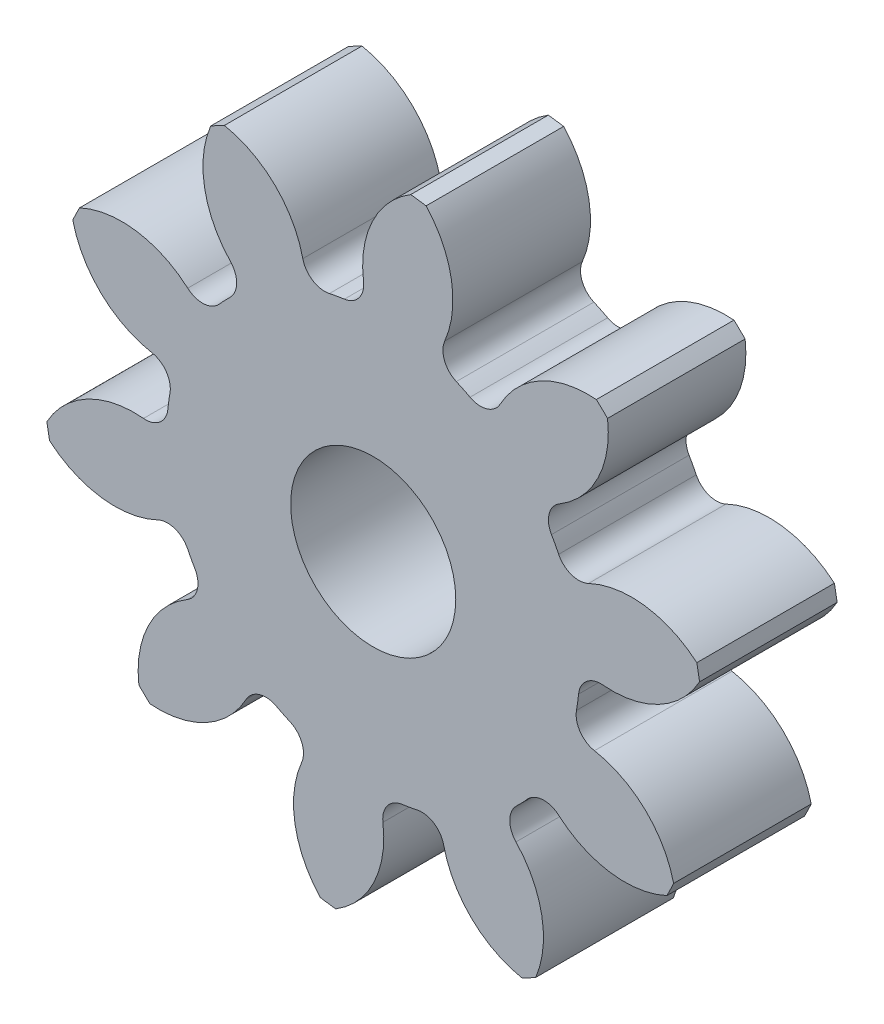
ISO-10303-21;
HEADER;
FILE_DESCRIPTION(('STEP AP214'),'2;1');
FILE_NAME('part.step','',(''),(''),'','','');
FILE_SCHEMA(('AUTOMOTIVE_DESIGN { 1 0 10303 214 1 1 1 1 }'));
ENDSEC;
DATA;
#1=APPLICATION_CONTEXT('core data for automotive mechanical design processes');
#2=APPLICATION_PROTOCOL_DEFINITION('international standard','automotive_design',2000,#1);
#3=PRODUCT_CONTEXT('',#1,'mechanical');
#4=PRODUCT('Part','Part','',(#3));
#5=PRODUCT_RELATED_PRODUCT_CATEGORY('part','',(#4));
#6=PRODUCT_DEFINITION_FORMATION('','',#4);
#7=PRODUCT_DEFINITION_CONTEXT('part definition',#1,'design');
#8=PRODUCT_DEFINITION('design','',#6,#7);
#9=PRODUCT_DEFINITION_SHAPE('','',#8);
#10=(LENGTH_UNIT() NAMED_UNIT(*) SI_UNIT(.MILLI.,.METRE.));
#11=(NAMED_UNIT(*) PLANE_ANGLE_UNIT() SI_UNIT($,.RADIAN.));
#12=(NAMED_UNIT(*) SI_UNIT($,.STERADIAN.) SOLID_ANGLE_UNIT());
#13=UNCERTAINTY_MEASURE_WITH_UNIT(LENGTH_MEASURE(1.E-05),#10,'distance_accuracy_value','');
#14=(GEOMETRIC_REPRESENTATION_CONTEXT(3) GLOBAL_UNCERTAINTY_ASSIGNED_CONTEXT((#13)) GLOBAL_UNIT_ASSIGNED_CONTEXT((#10,
#11,#12)) REPRESENTATION_CONTEXT('',''));
#15=CARTESIAN_POINT('',(0.,0.,0.));
#16=DIRECTION('',(0.,0.,1.));
#17=DIRECTION('',(1.,0.,0.));
#18=AXIS2_PLACEMENT_3D('',#15,#16,#17);
#19=CARTESIAN_POINT('',(0.,0.,127.));
#20=DIRECTION('',(0.,0.,-1.));
#21=DIRECTION('',(-1.,0.,0.));
#22=AXIS2_PLACEMENT_3D('',#19,#20,#21);
#23=CYLINDRICAL_SURFACE('',#22,304.8);
#24=DIRECTION('',(0.,0.,-1.));
#25=VECTOR('',#24,1.);
#26=CARTESIAN_POINT('',(298.701912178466,60.6647151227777,63.5));
#27=LINE('',#26,#25);
#28=CARTESIAN_POINT('',(298.701912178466,60.6647151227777,127.));
#29=VERTEX_POINT('',#28);
#30=CARTESIAN_POINT('',(298.701912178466,60.6647151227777,0.));
#31=VERTEX_POINT('',#30);
#32=EDGE_CURVE('E456',#29,#31,#27,.T.);
#33=ORIENTED_EDGE('',*,*,#32,.F.);
#34=CARTESIAN_POINT('',(0.,0.,127.));
#35=DIRECTION('',(0.,0.,1.));
#36=DIRECTION('',(1.,0.,0.));
#37=AXIS2_PLACEMENT_3D('',#34,#35,#36);
#38=CIRCLE('',#37,304.8);
#39=CARTESIAN_POINT('',(301.21936323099,46.582563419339,127.));
#40=VERTEX_POINT('',#39);
#41=EDGE_CURVE('E797',#40,#29,#38,.T.);
#42=ORIENTED_EDGE('',*,*,#41,.F.);
#43=DIRECTION('',(0.,0.,-1.));
#44=VECTOR('',#43,1.);
#45=CARTESIAN_POINT('',(301.21936323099,46.582563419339,63.5));
#46=LINE('',#45,#44);
#47=CARTESIAN_POINT('',(301.21936323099,46.582563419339,0.));
#48=VERTEX_POINT('',#47);
#49=EDGE_CURVE('E791',#48,#40,#46,.F.);
#50=ORIENTED_EDGE('',*,*,#49,.F.);
#51=CARTESIAN_POINT('',(0.,0.,0.));
#52=DIRECTION('',(0.,0.,1.));
#53=DIRECTION('',(1.,0.,0.));
#54=AXIS2_PLACEMENT_3D('',#51,#52,#53);
#55=CIRCLE('',#54,304.8);
#56=EDGE_CURVE('E802',#48,#31,#55,.T.);
#57=ORIENTED_EDGE('',*,*,#56,.T.);
#58=EDGE_LOOP('',(#33,#42,#50,#57));
#59=FACE_BOUND('',#58,.T.);
#60=ADVANCED_FACE('F33',(#59),#23,.T.);
#61=DIRECTION('',(0.,0.,-1.));
#62=VECTOR('',#61,1.);
#63=CARTESIAN_POINT('',(216.311040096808,214.738384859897,63.5));
#64=LINE('',#63,#62);
#65=CARTESIAN_POINT('',(216.311040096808,214.738384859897,0.));
#66=VERTEX_POINT('',#65);
#67=CARTESIAN_POINT('',(216.311040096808,214.738384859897,127.));
#68=VERTEX_POINT('',#67);
#69=EDGE_CURVE('E427',#66,#68,#64,.F.);
#70=ORIENTED_EDGE('',*,*,#69,.F.);
#71=CARTESIAN_POINT('',(205.997098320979,224.651364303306,0.));
#72=VERTEX_POINT('',#71);
#73=EDGE_CURVE('E805',#66,#72,#55,.T.);
#74=ORIENTED_EDGE('',*,*,#73,.T.);
#75=DIRECTION('',(0.,0.,-1.));
#76=VECTOR('',#75,1.);
#77=CARTESIAN_POINT('',(205.997098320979,224.651364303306,63.5));
#78=LINE('',#77,#76);
#79=CARTESIAN_POINT('',(205.997098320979,224.651364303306,127.));
#80=VERTEX_POINT('',#79);
#81=EDGE_CURVE('E489',#80,#72,#78,.T.);
#82=ORIENTED_EDGE('',*,*,#81,.F.);
#83=EDGE_CURVE('E800',#68,#80,#38,.T.);
#84=ORIENTED_EDGE('',*,*,#83,.F.);
#85=EDGE_LOOP('',(#70,#74,#82,#84));
#86=FACE_BOUND('',#85,.T.);
#87=ADVANCED_FACE('F921',(#86),#23,.T.);
#88=CARTESIAN_POINT('',(0.,0.,127.));
#89=DIRECTION('',(0.,0.,1.));
#90=DIRECTION('',(1.,0.,0.));
#91=AXIS2_PLACEMENT_3D('',#88,#89,#90);
#92=PLANE('',#91);
#93=CARTESIAN_POINT('',(0.,0.,127.000000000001));
#94=DIRECTION('',(0.,0.,1.));
#95=DIRECTION('',(1.,0.,0.));
#96=AXIS2_PLACEMENT_3D('',#93,#94,#95);
#97=CIRCLE('',#96,76.2);
#98=CARTESIAN_POINT('',(76.2,0.,127.000000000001));
#99=VERTEX_POINT('',#98);
#100=EDGE_CURVE('E444',#99,#99,#97,.T.);
#101=ORIENTED_EDGE('',*,*,#100,.F.);
#102=EDGE_LOOP('',(#101));
#103=FACE_BOUND('',#102,.T.);
#104=ORIENTED_EDGE('',*,*,#41,.T.);
#105=CARTESIAN_POINT('',(238.501373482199,-9.28205221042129,127.));
#106=DIRECTION('',(0.,0.,-1.));
#107=DIRECTION('',(0.809016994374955,0.587785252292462,0.));
#108=AXIS2_PLACEMENT_3D('',#105,#106,#107);
#109=CIRCLE('',#108,92.2857254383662);
#110=CARTESIAN_POINT('',(198.694080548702,73.976788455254,127.));
#111=VERTEX_POINT('',#110);
#112=EDGE_CURVE('E436',#111,#29,#109,.T.);
#113=ORIENTED_EDGE('',*,*,#112,.F.);
#114=CARTESIAN_POINT('',(189.775695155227,92.6300143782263,127.));
#115=DIRECTION('',(0.,0.,1.));
#116=DIRECTION('',(-0.809016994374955,-0.587785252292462,0.));
#117=AXIS2_PLACEMENT_3D('',#114,#115,#116);
#118=CIRCLE('',#117,20.6756);
#119=CARTESIAN_POINT('',(171.195298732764,83.5608741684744,127.));
#120=VERTEX_POINT('',#119);
#121=EDGE_CURVE('E434',#120,#111,#118,.T.);
#122=ORIENTED_EDGE('',*,*,#121,.F.);
#123=CARTESIAN_POINT('',(0.,0.,127.));
#124=DIRECTION('',(0.,0.,-1.));
#125=DIRECTION('',(0.809016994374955,0.587785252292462,0.));
#126=AXIS2_PLACEMENT_3D('',#123,#124,#125);
#127=CIRCLE('',#126,190.5);
#128=CARTESIAN_POINT('',(164.553713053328,95.9808601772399,127.));
#129=VERTEX_POINT('',#128);
#130=EDGE_CURVE('E419',#129,#120,#127,.T.);
#131=ORIENTED_EDGE('',*,*,#130,.F.);
#132=CARTESIAN_POINT('',(182.413276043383,106.397982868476,127.));
#133=DIRECTION('',(0.,0.,1.));
#134=DIRECTION('',(-0.809016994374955,-0.587785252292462,0.));
#135=AXIS2_PLACEMENT_3D('',#132,#133,#134);
#136=CIRCLE('',#135,20.6756);
#137=CARTESIAN_POINT('',(171.851874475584,124.172606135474,127.));
#138=VERTEX_POINT('',#137);
#139=EDGE_CURVE('E411',#138,#129,#136,.T.);
#140=ORIENTED_EDGE('',*,*,#139,.F.);
#141=CARTESIAN_POINT('',(124.71096415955,203.509795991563,127.));
#142=DIRECTION('',(0.,0.,-1.));
#143=DIRECTION('',(-0.809016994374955,-0.587785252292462,0.));
#144=AXIS2_PLACEMENT_3D('',#141,#142,#143);
#145=CIRCLE('',#144,92.2857254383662);
#146=EDGE_CURVE('E441',#68,#138,#145,.T.);
#147=ORIENTED_EDGE('',*,*,#146,.F.);
#148=ORIENTED_EDGE('',*,*,#83,.T.);
#149=CARTESIAN_POINT('',(198.407517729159,132.678252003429,127.));
#150=DIRECTION('',(0.,0.,-1.));
#151=DIRECTION('',(0.309016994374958,0.95105651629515,0.));
#152=AXIS2_PLACEMENT_3D('',#149,#150,#151);
#153=CIRCLE('',#152,92.2857254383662);
#154=CARTESIAN_POINT('',(117.264422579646,176.637929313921,127.));
#155=VERTEX_POINT('',#154);
#156=EDGE_CURVE('E465',#155,#80,#153,.T.);
#157=ORIENTED_EDGE('',*,*,#156,.F.);
#158=CARTESIAN_POINT('',(99.0852061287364,186.486610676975,127.));
#159=DIRECTION('',(0.,0.,1.));
#160=DIRECTION('',(-0.309016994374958,-0.95105651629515,0.));
#161=AXIS2_PLACEMENT_3D('',#158,#159,#160);
#162=CIRCLE('',#161,20.6756);
#163=CARTESIAN_POINT('',(89.3840565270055,168.228239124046,127.));
#164=VERTEX_POINT('',#163);
#165=EDGE_CURVE('E463',#164,#155,#162,.T.);
#166=ORIENTED_EDGE('',*,*,#165,.F.);
#167=CARTESIAN_POINT('',(0.,0.,127.));
#168=DIRECTION('',(0.,0.,-1.));
#169=DIRECTION('',(0.309016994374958,0.95105651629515,0.));
#170=AXIS2_PLACEMENT_3D('',#167,#168,#169);
#171=CIRCLE('',#170,190.5);
#172=CARTESIAN_POINT('',(76.7106162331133,174.372392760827,127.));
#173=VERTEX_POINT('',#172);
#174=EDGE_CURVE('E460',#173,#164,#171,.T.);
#175=ORIENTED_EDGE('',*,*,#174,.F.);
#176=CARTESIAN_POINT('',(85.0362751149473,193.297609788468,127.));
#177=DIRECTION('',(0.,0.,1.));
#178=DIRECTION('',(-0.309016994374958,-0.95105651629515,0.));
#179=AXIS2_PLACEMENT_3D('',#176,#177,#178);
#180=CIRCLE('',#179,20.6756);
#181=CARTESIAN_POINT('',(66.044260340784,201.469745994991,127.));
#182=VERTEX_POINT('',#181);
#183=EDGE_CURVE('E458',#182,#173,#180,.T.);
#184=ORIENTED_EDGE('',*,*,#183,.F.);
#185=CARTESIAN_POINT('',(-18.7267673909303,237.946149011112,127.));
#186=DIRECTION('',(0.,0.,-1.));
#187=DIRECTION('',(-0.309016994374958,-0.95105651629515,0.));
#188=AXIS2_PLACEMENT_3D('',#185,#186,#187);
#189=CIRCLE('',#188,92.2857254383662);
#190=CARTESIAN_POINT('',(48.779251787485,300.871441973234,127.));
#191=VERTEX_POINT('',#190);
#192=EDGE_CURVE('E468',#191,#182,#189,.T.);
#193=ORIENTED_EDGE('',*,*,#192,.F.);
#194=CARTESIAN_POINT('',(34.6083944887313,302.828827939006,127.));
#195=VERTEX_POINT('',#194);
#196=EDGE_CURVE('E833',#191,#195,#38,.T.);
#197=ORIENTED_EDGE('',*,*,#196,.T.);
#198=CARTESIAN_POINT('',(82.528733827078,223.959973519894,127.));
#199=DIRECTION('',(0.,0.,-1.));
#200=DIRECTION('',(-0.309016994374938,0.951056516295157,0.));
#201=AXIS2_PLACEMENT_3D('',#198,#199,#200);
#202=CIRCLE('',#201,92.2857254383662);
#203=CARTESIAN_POINT('',(-8.95625914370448,211.829384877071,127.));
#204=VERTEX_POINT('',#203);
#205=EDGE_CURVE('E500',#204,#195,#202,.T.);
#206=ORIENTED_EDGE('',*,*,#205,.F.);
#207=CARTESIAN_POINT('',(-29.4524638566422,209.111660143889,127.));
#208=DIRECTION('',(0.,0.,1.));
#209=DIRECTION('',(0.309016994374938,-0.951056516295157,0.));
#210=AXIS2_PLACEMENT_3D('',#207,#208,#209);
#211=CIRCLE('',#210,20.6756);
#212=CARTESIAN_POINT('',(-26.5688572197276,188.638134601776,127.));
#213=VERTEX_POINT('',#212);
#214=EDGE_CURVE('E498',#213,#204,#211,.T.);
#215=ORIENTED_EDGE('',*,*,#214,.F.);
#216=CARTESIAN_POINT('',(0.,0.,127.));
#217=DIRECTION('',(0.,0.,-1.));
#218=DIRECTION('',(-0.309016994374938,0.951056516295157,0.));
#219=AXIS2_PLACEMENT_3D('',#216,#217,#218);
#220=CIRCLE('',#219,190.5);
#221=CARTESIAN_POINT('',(-40.4333286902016,186.159598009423,127.));
#222=VERTEX_POINT('',#221);
#223=EDGE_CURVE('E495',#222,#213,#220,.T.);
#224=ORIENTED_EDGE('',*,*,#223,.F.);
#225=CARTESIAN_POINT('',(-44.8216926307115,206.36411971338,127.));
#226=DIRECTION('',(0.,0.,1.));
#227=DIRECTION('',(0.309016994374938,-0.951056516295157,0.));
#228=AXIS2_PLACEMENT_3D('',#225,#226,#227);
#229=CIRCLE('',#228,20.6756);
#230=CARTESIAN_POINT('',(-64.9900164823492,201.812290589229,127.));
#231=VERTEX_POINT('',#230);
#232=EDGE_CURVE('E493',#231,#222,#229,.T.);
#233=ORIENTED_EDGE('',*,*,#232,.F.);
#234=CARTESIAN_POINT('',(-155.011510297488,181.495160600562,127.));
#235=DIRECTION('',(0.,0.,-1.));
#236=DIRECTION('',(0.309016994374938,-0.951056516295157,0.));
#237=AXIS2_PLACEMENT_3D('',#234,#235,#236);
#238=CIRCLE('',#237,92.2857254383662);
#239=CARTESIAN_POINT('',(-137.384552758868,272.081834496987,127.));
#240=VERTEX_POINT('',#239);
#241=EDGE_CURVE('E503',#240,#231,#238,.T.);
#242=ORIENTED_EDGE('',*,*,#241,.F.);
#243=CARTESIAN_POINT('',(-149.999539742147,265.335972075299,127.));
#244=VERTEX_POINT('',#243);
#245=EDGE_CURVE('E903',#240,#244,#38,.T.);
#246=ORIENTED_EDGE('',*,*,#245,.T.);
#247=CARTESIAN_POINT('',(-64.8732213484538,229.696597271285,127.));
#248=DIRECTION('',(0.,0.,-1.));
#249=DIRECTION('',(-0.809016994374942,0.58778525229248,0.));
#250=AXIS2_PLACEMENT_3D('',#247,#248,#249);
#251=CIRCLE('',#250,92.2857254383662);
#252=CARTESIAN_POINT('',(-131.755954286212,166.109215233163,127.));
#253=VERTEX_POINT('',#252);
#254=EDGE_CURVE('E538',#253,#244,#251,.T.);
#255=ORIENTED_EDGE('',*,*,#254,.F.);
#256=CARTESIAN_POINT('',(-146.740293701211,151.863162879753,127.));
#257=DIRECTION('',(0.,0.,1.));
#258=DIRECTION('',(0.809016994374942,-0.58778525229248,0.));
#259=AXIS2_PLACEMENT_3D('',#256,#257,#258);
#260=CIRCLE('',#259,20.6756);
#261=CARTESIAN_POINT('',(-132.373370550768,136.994674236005,127.));
#262=VERTEX_POINT('',#261);
#263=EDGE_CURVE('E536',#262,#253,#260,.T.);
#264=ORIENTED_EDGE('',*,*,#263,.F.);
#265=CARTESIAN_POINT('',(0.,0.,127.));
#266=DIRECTION('',(0.,0.,-1.));
#267=DIRECTION('',(-0.809016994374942,0.58778525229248,0.));
#268=AXIS2_PLACEMENT_3D('',#265,#266,#267);
#269=CIRCLE('',#268,190.5);
#270=CARTESIAN_POINT('',(-142.133116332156,126.840164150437,127.));
#271=VERTEX_POINT('',#270);
#272=EDGE_CURVE('E533',#271,#262,#269,.T.);
#273=ORIENTED_EDGE('',*,*,#272,.F.);
#274=CARTESIAN_POINT('',(-157.559297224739,140.606549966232,127.));
#275=DIRECTION('',(0.,0.,1.));
#276=DIRECTION('',(0.809016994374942,-0.58778525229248,0.));
#277=AXIS2_PLACEMENT_3D('',#274,#275,#276);
#278=CIRCLE('',#277,20.6756);
#279=CARTESIAN_POINT('',(-171.200315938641,125.069399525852,127.));
#280=VERTEX_POINT('',#279);
#281=EDGE_CURVE('E531',#280,#271,#278,.T.);
#282=ORIENTED_EDGE('',*,*,#281,.F.);
#283=CARTESIAN_POINT('',(-232.08712491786,55.7191896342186,127.));
#284=DIRECTION('',(0.,0.,-1.));
#285=DIRECTION('',(0.809016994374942,-0.58778525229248,0.));
#286=AXIS2_PLACEMENT_3D('',#283,#284,#285);
#287=CIRCLE('',#286,92.2857254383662);
#288=CARTESIAN_POINT('',(-271.072127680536,139.366213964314,127.));
#289=VERTEX_POINT('',#288);
#290=EDGE_CURVE('E541',#289,#280,#287,.T.);
#291=ORIENTED_EDGE('',*,*,#290,.F.);
#292=CARTESIAN_POINT('',(-277.312748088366,126.49379331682,127.));
#293=VERTEX_POINT('',#292);
#294=EDGE_CURVE('E899',#289,#293,#38,.T.);
#295=ORIENTED_EDGE('',*,*,#294,.T.);
#296=CARTESIAN_POINT('',(-187.495810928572,147.696927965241,127.));
#297=DIRECTION('',(0.,0.,-1.));
#298=DIRECTION('',(-1.,0.,0.));
#299=AXIS2_PLACEMENT_3D('',#296,#297,#298);
#300=CIRCLE('',#299,92.2857254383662);
#301=CARTESIAN_POINT('',(-204.229353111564,56.9409712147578,127.));
#302=VERTEX_POINT('',#301);
#303=EDGE_CURVE('E576',#302,#293,#300,.T.);
#304=ORIENTED_EDGE('',*,*,#303,.F.);
#305=CARTESIAN_POINT('',(-207.978318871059,36.6080990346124,127.));
#306=DIRECTION('',(0.,0.,1.));
#307=DIRECTION('',(1.,0.,0.));
#308=AXIS2_PLACEMENT_3D('',#305,#306,#307);
#309=CIRCLE('',#308,20.6756);
#310=CARTESIAN_POINT('',(-187.615755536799,33.0239045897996,127.));
#311=VERTEX_POINT('',#310);
#312=EDGE_CURVE('E574',#311,#302,#309,.T.);
#313=ORIENTED_EDGE('',*,*,#312,.F.);
#314=CARTESIAN_POINT('',(0.,0.,127.));
#315=DIRECTION('',(0.,0.,-1.));
#316=DIRECTION('',(-1.,0.,0.));
#317=AXIS2_PLACEMENT_3D('',#314,#315,#316);
#318=CIRCLE('',#317,190.5);
#319=CARTESIAN_POINT('',(-189.542884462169,19.0720987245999,127.));
#320=VERTEX_POINT('',#319);
#321=EDGE_CURVE('E571',#320,#311,#318,.T.);
#322=ORIENTED_EDGE('',*,*,#321,.F.);
#323=CARTESIAN_POINT('',(-210.114605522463,21.1420571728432,127.));
#324=DIRECTION('',(0.,0.,1.));
#325=DIRECTION('',(1.,0.,0.));
#326=AXIS2_PLACEMENT_3D('',#323,#324,#325);
#327=CIRCLE('',#326,20.6756);
#328=CARTESIAN_POINT('',(-212.017913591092,0.554248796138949,127.));
#329=VERTEX_POINT('',#328);
#330=EDGE_CURVE('E569',#329,#320,#327,.T.);
#331=ORIENTED_EDGE('',*,*,#330,.F.);
#332=CARTESIAN_POINT('',(-220.513346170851,-91.3396179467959,127.));
#333=DIRECTION('',(0.,0.,-1.));
#334=DIRECTION('',(1.,0.,0.));
#335=AXIS2_PLACEMENT_3D('',#332,#333,#334);
#336=CIRCLE('',#335,92.2857254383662);
#337=CARTESIAN_POINT('',(-301.219363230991,-46.5825634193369,127.));
#338=VERTEX_POINT('',#337);
#339=EDGE_CURVE('E579',#338,#329,#336,.T.);
#340=ORIENTED_EDGE('',*,*,#339,.F.);
#341=CARTESIAN_POINT('',(-298.701912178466,-60.6647151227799,127.));
#342=VERTEX_POINT('',#341);
#343=EDGE_CURVE('E895',#338,#342,#38,.T.);
#344=ORIENTED_EDGE('',*,*,#343,.T.);
#345=CARTESIAN_POINT('',(-238.501373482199,9.2820522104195,127.));
#346=DIRECTION('',(0.,0.,-1.));
#347=DIRECTION('',(-0.809016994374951,-0.587785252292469,0.));
#348=AXIS2_PLACEMENT_3D('',#345,#346,#347);
#349=CIRCLE('',#348,92.2857254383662);
#350=CARTESIAN_POINT('',(-198.694080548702,-73.9767884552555,127.));
#351=VERTEX_POINT('',#350);
#352=EDGE_CURVE('E614',#351,#342,#349,.T.);
#353=ORIENTED_EDGE('',*,*,#352,.F.);
#354=CARTESIAN_POINT('',(-189.775695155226,-92.6300143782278,127.));
#355=DIRECTION('',(0.,0.,1.));
#356=DIRECTION('',(0.809016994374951,0.587785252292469,0.));
#357=AXIS2_PLACEMENT_3D('',#354,#355,#356);
#358=CIRCLE('',#357,20.6756);
#359=CARTESIAN_POINT('',(-171.195298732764,-83.5608741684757,127.));
#360=VERTEX_POINT('',#359);
#361=EDGE_CURVE('E612',#360,#351,#358,.T.);
#362=ORIENTED_EDGE('',*,*,#361,.F.);
#363=CARTESIAN_POINT('',(0.,0.,127.));
#364=DIRECTION('',(0.,0.,-1.));
#365=DIRECTION('',(-0.809016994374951,-0.587785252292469,0.));
#366=AXIS2_PLACEMENT_3D('',#363,#364,#365);
#367=CIRCLE('',#366,190.5);
#368=CARTESIAN_POINT('',(-164.553713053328,-95.9808601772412,127.));
#369=VERTEX_POINT('',#368);
#370=EDGE_CURVE('E609',#369,#360,#367,.T.);
#371=ORIENTED_EDGE('',*,*,#370,.F.);
#372=CARTESIAN_POINT('',(-182.413276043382,-106.397982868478,127.));
#373=DIRECTION('',(0.,0.,1.));
#374=DIRECTION('',(0.809016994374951,0.587785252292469,0.));
#375=AXIS2_PLACEMENT_3D('',#372,#373,#374);
#376=CIRCLE('',#375,20.6756);
#377=CARTESIAN_POINT('',(-171.851874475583,-124.172606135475,127.));
#378=VERTEX_POINT('',#377);
#379=EDGE_CURVE('E607',#378,#369,#376,.T.);
#380=ORIENTED_EDGE('',*,*,#379,.F.);
#381=CARTESIAN_POINT('',(-124.710964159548,-203.509795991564,127.));
#382=DIRECTION('',(0.,0.,-1.));
#383=DIRECTION('',(0.809016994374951,0.587785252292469,0.));
#384=AXIS2_PLACEMENT_3D('',#381,#382,#383);
#385=CIRCLE('',#384,92.2857254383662);
#386=CARTESIAN_POINT('',(-216.311040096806,-214.738384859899,127.));
#387=VERTEX_POINT('',#386);
#388=EDGE_CURVE('E617',#387,#378,#385,.T.);
#389=ORIENTED_EDGE('',*,*,#388,.F.);
#390=CARTESIAN_POINT('',(-205.997098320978,-224.651364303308,127.));
#391=VERTEX_POINT('',#390);
#392=EDGE_CURVE('E891',#387,#391,#38,.T.);
#393=ORIENTED_EDGE('',*,*,#392,.T.);
#394=CARTESIAN_POINT('',(-198.407517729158,-132.678252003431,127.));
#395=DIRECTION('',(0.,0.,-1.));
#396=DIRECTION('',(-0.309016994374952,-0.951056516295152,0.));
#397=AXIS2_PLACEMENT_3D('',#394,#395,#396);
#398=CIRCLE('',#397,92.2857254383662);
#399=CARTESIAN_POINT('',(-117.264422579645,-176.637929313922,127.));
#400=VERTEX_POINT('',#399);
#401=EDGE_CURVE('E652',#400,#391,#398,.T.);
#402=ORIENTED_EDGE('',*,*,#401,.F.);
#403=CARTESIAN_POINT('',(-99.0852061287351,-186.486610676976,127.));
#404=DIRECTION('',(0.,0.,1.));
#405=DIRECTION('',(0.309016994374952,0.951056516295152,0.));
#406=AXIS2_PLACEMENT_3D('',#403,#404,#405);
#407=CIRCLE('',#406,20.6756);
#408=CARTESIAN_POINT('',(-89.3840565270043,-168.228239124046,127.));
#409=VERTEX_POINT('',#408);
#410=EDGE_CURVE('E650',#409,#400,#407,.T.);
#411=ORIENTED_EDGE('',*,*,#410,.F.);
#412=CARTESIAN_POINT('',(0.,0.,127.));
#413=DIRECTION('',(0.,0.,-1.));
#414=DIRECTION('',(-0.309016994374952,-0.951056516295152,0.));
#415=AXIS2_PLACEMENT_3D('',#412,#413,#414);
#416=CIRCLE('',#415,190.5);
#417=CARTESIAN_POINT('',(-76.7106162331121,-174.372392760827,127.));
#418=VERTEX_POINT('',#417);
#419=EDGE_CURVE('E647',#418,#409,#416,.T.);
#420=ORIENTED_EDGE('',*,*,#419,.F.);
#421=CARTESIAN_POINT('',(-85.036275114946,-193.297609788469,127.));
#422=DIRECTION('',(0.,0.,1.));
#423=DIRECTION('',(0.309016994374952,0.951056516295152,0.));
#424=AXIS2_PLACEMENT_3D('',#421,#422,#423);
#425=CIRCLE('',#424,20.6756);
#426=CARTESIAN_POINT('',(-66.0442603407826,-201.469745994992,127.));
#427=VERTEX_POINT('',#426);
#428=EDGE_CURVE('E645',#427,#418,#425,.T.);
#429=ORIENTED_EDGE('',*,*,#428,.F.);
#430=CARTESIAN_POINT('',(18.726767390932,-237.946149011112,127.));
#431=DIRECTION('',(0.,0.,-1.));
#432=DIRECTION('',(0.309016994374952,0.951056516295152,0.));
#433=AXIS2_PLACEMENT_3D('',#430,#431,#432);
#434=CIRCLE('',#433,92.2857254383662);
#435=CARTESIAN_POINT('',(-48.7792517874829,-300.871441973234,127.));
#436=VERTEX_POINT('',#435);
#437=EDGE_CURVE('E655',#436,#427,#434,.T.);
#438=ORIENTED_EDGE('',*,*,#437,.F.);
#439=CARTESIAN_POINT('',(-34.6083944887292,-302.828827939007,127.));
#440=VERTEX_POINT('',#439);
#441=EDGE_CURVE('E887',#436,#440,#38,.T.);
#442=ORIENTED_EDGE('',*,*,#441,.T.);
#443=CARTESIAN_POINT('',(-82.5287338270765,-223.959973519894,127.));
#444=DIRECTION('',(0.,0.,-1.));
#445=DIRECTION('',(0.309016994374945,-0.951056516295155,0.));
#446=AXIS2_PLACEMENT_3D('',#443,#444,#445);
#447=CIRCLE('',#446,92.2857254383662);
#448=CARTESIAN_POINT('',(8.95625914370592,-211.829384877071,127.));
#449=VERTEX_POINT('',#448);
#450=EDGE_CURVE('E690',#449,#440,#447,.T.);
#451=ORIENTED_EDGE('',*,*,#450,.F.);
#452=CARTESIAN_POINT('',(29.4524638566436,-209.111660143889,127.));
#453=DIRECTION('',(0.,0.,1.));
#454=DIRECTION('',(-0.309016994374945,0.951056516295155,0.));
#455=AXIS2_PLACEMENT_3D('',#452,#453,#454);
#456=CIRCLE('',#455,20.6756);
#457=CARTESIAN_POINT('',(26.5688572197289,-188.638134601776,127.));
#458=VERTEX_POINT('',#457);
#459=EDGE_CURVE('E688',#458,#449,#456,.T.);
#460=ORIENTED_EDGE('',*,*,#459,.F.);
#461=CARTESIAN_POINT('',(0.,0.,127.));
#462=DIRECTION('',(0.,0.,-1.));
#463=DIRECTION('',(0.309016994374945,-0.951056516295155,0.));
#464=AXIS2_PLACEMENT_3D('',#461,#462,#463);
#465=CIRCLE('',#464,190.5);
#466=CARTESIAN_POINT('',(40.4333286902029,-186.159598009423,127.));
#467=VERTEX_POINT('',#466);
#468=EDGE_CURVE('E685',#467,#458,#465,.T.);
#469=ORIENTED_EDGE('',*,*,#468,.F.);
#470=CARTESIAN_POINT('',(44.8216926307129,-206.364119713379,127.));
#471=DIRECTION('',(0.,0.,1.));
#472=DIRECTION('',(-0.309016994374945,0.951056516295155,0.));
#473=AXIS2_PLACEMENT_3D('',#470,#471,#472);
#474=CIRCLE('',#473,20.6756);
#475=CARTESIAN_POINT('',(64.9900164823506,-201.812290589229,127.));
#476=VERTEX_POINT('',#475);
#477=EDGE_CURVE('E683',#476,#467,#474,.T.);
#478=ORIENTED_EDGE('',*,*,#477,.F.);
#479=CARTESIAN_POINT('',(155.011510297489,-181.495160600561,127.));
#480=DIRECTION('',(0.,0.,-1.));
#481=DIRECTION('',(-0.309016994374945,0.951056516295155,0.));
#482=AXIS2_PLACEMENT_3D('',#479,#480,#481);
#483=CIRCLE('',#482,92.2857254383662);
#484=CARTESIAN_POINT('',(137.38455275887,-272.081834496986,127.));
#485=VERTEX_POINT('',#484);
#486=EDGE_CURVE('E693',#485,#476,#483,.T.);
#487=ORIENTED_EDGE('',*,*,#486,.F.);
#488=CARTESIAN_POINT('',(149.999539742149,-265.335972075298,127.));
#489=VERTEX_POINT('',#488);
#490=EDGE_CURVE('E886',#485,#489,#38,.T.);
#491=ORIENTED_EDGE('',*,*,#490,.T.);
#492=CARTESIAN_POINT('',(64.8732213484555,-229.696597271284,127.));
#493=DIRECTION('',(0.,0.,-1.));
#494=DIRECTION('',(0.809016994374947,-0.587785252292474,0.));
#495=AXIS2_PLACEMENT_3D('',#492,#493,#494);
#496=CIRCLE('',#495,92.2857254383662);
#497=CARTESIAN_POINT('',(131.755954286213,-166.109215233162,127.));
#498=VERTEX_POINT('',#497);
#499=EDGE_CURVE('E728',#498,#489,#496,.T.);
#500=ORIENTED_EDGE('',*,*,#499,.F.);
#501=CARTESIAN_POINT('',(146.740293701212,-151.863162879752,127.));
#502=DIRECTION('',(0.,0.,1.));
#503=DIRECTION('',(-0.809016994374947,0.587785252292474,0.));
#504=AXIS2_PLACEMENT_3D('',#501,#502,#503);
#505=CIRCLE('',#504,20.6756);
#506=CARTESIAN_POINT('',(132.373370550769,-136.994674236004,127.));
#507=VERTEX_POINT('',#506);
#508=EDGE_CURVE('E726',#507,#498,#505,.T.);
#509=ORIENTED_EDGE('',*,*,#508,.F.);
#510=CARTESIAN_POINT('',(0.,0.,127.));
#511=DIRECTION('',(0.,0.,-1.));
#512=DIRECTION('',(0.809016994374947,-0.587785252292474,0.));
#513=AXIS2_PLACEMENT_3D('',#510,#511,#512);
#514=CIRCLE('',#513,190.5);
#515=CARTESIAN_POINT('',(142.133116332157,-126.840164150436,127.));
#516=VERTEX_POINT('',#515);
#517=EDGE_CURVE('E723',#516,#507,#514,.T.);
#518=ORIENTED_EDGE('',*,*,#517,.F.);
#519=CARTESIAN_POINT('',(157.55929722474,-140.60654996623,127.));
#520=DIRECTION('',(0.,0.,1.));
#521=DIRECTION('',(-0.809016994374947,0.587785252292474,0.));
#522=AXIS2_PLACEMENT_3D('',#519,#520,#521);
#523=CIRCLE('',#522,20.6756);
#524=CARTESIAN_POINT('',(171.200315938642,-125.069399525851,127.));
#525=VERTEX_POINT('',#524);
#526=EDGE_CURVE('E721',#525,#516,#523,.T.);
#527=ORIENTED_EDGE('',*,*,#526,.F.);
#528=CARTESIAN_POINT('',(232.08712491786,-55.719189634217,127.));
#529=DIRECTION('',(0.,0.,-1.));
#530=DIRECTION('',(-0.809016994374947,0.587785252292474,0.));
#531=AXIS2_PLACEMENT_3D('',#528,#529,#530);
#532=CIRCLE('',#531,92.2857254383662);
#533=CARTESIAN_POINT('',(271.072127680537,-139.366213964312,127.));
#534=VERTEX_POINT('',#533);
#535=EDGE_CURVE('E731',#534,#525,#532,.T.);
#536=ORIENTED_EDGE('',*,*,#535,.F.);
#537=CARTESIAN_POINT('',(277.312748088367,-126.493793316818,127.));
#538=VERTEX_POINT('',#537);
#539=EDGE_CURVE('E801',#534,#538,#38,.T.);
#540=ORIENTED_EDGE('',*,*,#539,.T.);
#541=CARTESIAN_POINT('',(187.495810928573,-147.696927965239,127.));
#542=DIRECTION('',(0.,0.,-1.));
#543=DIRECTION('',(1.,0.,0.));
#544=AXIS2_PLACEMENT_3D('',#541,#542,#543);
#545=CIRCLE('',#544,92.2857254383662);
#546=CARTESIAN_POINT('',(204.229353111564,-56.9409712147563,127.));
#547=VERTEX_POINT('',#546);
#548=EDGE_CURVE('E766',#547,#538,#545,.T.);
#549=ORIENTED_EDGE('',*,*,#548,.F.);
#550=CARTESIAN_POINT('',(207.97831887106,-36.608099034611,127.));
#551=DIRECTION('',(0.,0.,1.));
#552=DIRECTION('',(-1.,0.,0.));
#553=AXIS2_PLACEMENT_3D('',#550,#551,#552);
#554=CIRCLE('',#553,20.6756);
#555=CARTESIAN_POINT('',(187.615755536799,-33.0239045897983,127.));
#556=VERTEX_POINT('',#555);
#557=EDGE_CURVE('E764',#556,#547,#554,.T.);
#558=ORIENTED_EDGE('',*,*,#557,.F.);
#559=CARTESIAN_POINT('',(0.,0.,127.));
#560=DIRECTION('',(0.,0.,-1.));
#561=DIRECTION('',(1.,0.,0.));
#562=AXIS2_PLACEMENT_3D('',#559,#560,#561);
#563=CIRCLE('',#562,190.5);
#564=CARTESIAN_POINT('',(189.542884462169,-19.0720987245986,127.));
#565=VERTEX_POINT('',#564);
#566=EDGE_CURVE('E761',#565,#556,#563,.T.);
#567=ORIENTED_EDGE('',*,*,#566,.F.);
#568=CARTESIAN_POINT('',(210.114605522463,-21.1420571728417,127.));
#569=DIRECTION('',(0.,0.,1.));
#570=DIRECTION('',(-1.,0.,0.));
#571=AXIS2_PLACEMENT_3D('',#568,#569,#570);
#572=CIRCLE('',#571,20.6756);
#573=CARTESIAN_POINT('',(212.017913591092,-0.554248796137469,127.));
#574=VERTEX_POINT('',#573);
#575=EDGE_CURVE('E759',#574,#565,#572,.T.);
#576=ORIENTED_EDGE('',*,*,#575,.F.);
#577=CARTESIAN_POINT('',(220.51334617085,91.3396179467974,127.));
#578=DIRECTION('',(0.,0.,-1.));
#579=DIRECTION('',(-1.,0.,0.));
#580=AXIS2_PLACEMENT_3D('',#577,#578,#579);
#581=CIRCLE('',#580,92.2857254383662);
#582=EDGE_CURVE('E769',#40,#574,#581,.T.);
#583=ORIENTED_EDGE('',*,*,#582,.F.);
#584=EDGE_LOOP('',(#104,#113,#122,#131,#140,#147,#148,#157,#166,#175,#184,#193,#197,#206,#215,
#224,#233,#242,#246,#255,#264,#273,#282,#291,#295,#304,#313,#322,#331,#340,#344,#353,#362,#371,
#380,#389,#393,#402,#411,#420,#429,#438,#442,#451,#460,#469,#478,#487,#491,#500,#509,#518,#527,
#536,#540,#549,#558,#567,#576,#583));
#585=FACE_BOUND('',#584,.T.);
#586=ADVANCED_FACE('F432',(#103,#585),#92,.T.);
#587=CARTESIAN_POINT('',(0.,0.,0.));
#588=DIRECTION('',(0.,0.,1.));
#589=DIRECTION('',(1.,0.,0.));
#590=AXIS2_PLACEMENT_3D('',#587,#588,#589);
#591=PLANE('',#590);
#592=CARTESIAN_POINT('',(0.,0.,0.));
#593=DIRECTION('',(0.,0.,1.));
#594=DIRECTION('',(1.,0.,0.));
#595=AXIS2_PLACEMENT_3D('',#592,#593,#594);
#596=CIRCLE('',#595,76.2);
#597=CARTESIAN_POINT('',(76.2,0.,-1.77635683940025E-12));
#598=VERTEX_POINT('',#597);
#599=EDGE_CURVE('E36',#598,#598,#596,.T.);
#600=ORIENTED_EDGE('',*,*,#599,.T.);
#601=EDGE_LOOP('',(#600));
#602=FACE_BOUND('',#601,.T.);
#603=CARTESIAN_POINT('',(238.501373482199,-9.28205221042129,0.));
#604=DIRECTION('',(0.,0.,-1.));
#605=DIRECTION('',(0.809016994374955,0.587785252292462,0.));
#606=AXIS2_PLACEMENT_3D('',#603,#604,#605);
#607=CIRCLE('',#606,92.2857254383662);
#608=CARTESIAN_POINT('',(198.694080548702,73.976788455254,0.));
#609=VERTEX_POINT('',#608);
#610=EDGE_CURVE('E420',#609,#31,#607,.T.);
#611=ORIENTED_EDGE('',*,*,#610,.T.);
#612=ORIENTED_EDGE('',*,*,#56,.F.);
#613=CARTESIAN_POINT('',(220.51334617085,91.3396179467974,0.));
#614=DIRECTION('',(0.,0.,1.));
#615=DIRECTION('',(1.,0.,0.));
#616=AXIS2_PLACEMENT_3D('',#613,#614,#615);
#617=CIRCLE('',#616,92.2857254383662);
#618=CARTESIAN_POINT('',(212.017913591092,-0.554248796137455,0.));
#619=VERTEX_POINT('',#618);
#620=EDGE_CURVE('E799',#619,#48,#617,.T.);
#621=ORIENTED_EDGE('',*,*,#620,.F.);
#622=CARTESIAN_POINT('',(210.114605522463,-21.1420571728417,0.));
#623=DIRECTION('',(0.,0.,1.));
#624=DIRECTION('',(-1.,0.,0.));
#625=AXIS2_PLACEMENT_3D('',#622,#623,#624);
#626=CIRCLE('',#625,20.6756);
#627=CARTESIAN_POINT('',(189.542884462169,-19.0720987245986,0.));
#628=VERTEX_POINT('',#627);
#629=EDGE_CURVE('E758',#619,#628,#626,.T.);
#630=ORIENTED_EDGE('',*,*,#629,.T.);
#631=CARTESIAN_POINT('',(0.,0.,0.));
#632=DIRECTION('',(0.,0.,-1.));
#633=DIRECTION('',(1.,0.,0.));
#634=AXIS2_PLACEMENT_3D('',#631,#632,#633);
#635=CIRCLE('',#634,190.5);
#636=CARTESIAN_POINT('',(187.615755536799,-33.0239045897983,0.));
#637=VERTEX_POINT('',#636);
#638=EDGE_CURVE('E774',#628,#637,#635,.T.);
#639=ORIENTED_EDGE('',*,*,#638,.T.);
#640=CARTESIAN_POINT('',(207.97831887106,-36.608099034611,0.));
#641=DIRECTION('',(0.,0.,1.));
#642=DIRECTION('',(-1.,0.,0.));
#643=AXIS2_PLACEMENT_3D('',#640,#641,#642);
#644=CIRCLE('',#643,20.6756);
#645=CARTESIAN_POINT('',(204.229353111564,-56.9409712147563,0.));
#646=VERTEX_POINT('',#645);
#647=EDGE_CURVE('E777',#637,#646,#644,.T.);
#648=ORIENTED_EDGE('',*,*,#647,.T.);
#649=CARTESIAN_POINT('',(187.495810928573,-147.696927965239,0.));
#650=DIRECTION('',(0.,0.,-1.));
#651=DIRECTION('',(1.,0.,0.));
#652=AXIS2_PLACEMENT_3D('',#649,#650,#651);
#653=CIRCLE('',#652,92.2857254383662);
#654=CARTESIAN_POINT('',(277.312748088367,-126.493793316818,0.));
#655=VERTEX_POINT('',#654);
#656=EDGE_CURVE('E762',#646,#655,#653,.T.);
#657=ORIENTED_EDGE('',*,*,#656,.T.);
#658=CARTESIAN_POINT('',(271.072127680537,-139.366213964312,0.));
#659=VERTEX_POINT('',#658);
#660=EDGE_CURVE('E796',#659,#655,#55,.T.);
#661=ORIENTED_EDGE('',*,*,#660,.F.);
#662=CARTESIAN_POINT('',(232.08712491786,-55.719189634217,0.));
#663=DIRECTION('',(0.,0.,1.));
#664=DIRECTION('',(1.,0.,0.));
#665=AXIS2_PLACEMENT_3D('',#662,#663,#664);
#666=CIRCLE('',#665,92.2857254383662);
#667=CARTESIAN_POINT('',(171.200315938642,-125.069399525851,0.));
#668=VERTEX_POINT('',#667);
#669=EDGE_CURVE('E807',#668,#659,#666,.T.);
#670=ORIENTED_EDGE('',*,*,#669,.F.);
#671=CARTESIAN_POINT('',(157.55929722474,-140.60654996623,0.));
#672=DIRECTION('',(0.,0.,1.));
#673=DIRECTION('',(-0.809016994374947,0.587785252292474,0.));
#674=AXIS2_PLACEMENT_3D('',#671,#672,#673);
#675=CIRCLE('',#674,20.6756);
#676=CARTESIAN_POINT('',(142.133116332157,-126.840164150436,0.));
#677=VERTEX_POINT('',#676);
#678=EDGE_CURVE('E720',#668,#677,#675,.T.);
#679=ORIENTED_EDGE('',*,*,#678,.T.);
#680=CARTESIAN_POINT('',(0.,0.,0.));
#681=DIRECTION('',(0.,0.,-1.));
#682=DIRECTION('',(0.809016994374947,-0.587785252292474,0.));
#683=AXIS2_PLACEMENT_3D('',#680,#681,#682);
#684=CIRCLE('',#683,190.5);
#685=CARTESIAN_POINT('',(132.373370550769,-136.994674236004,0.));
#686=VERTEX_POINT('',#685);
#687=EDGE_CURVE('E736',#677,#686,#684,.T.);
#688=ORIENTED_EDGE('',*,*,#687,.T.);
#689=CARTESIAN_POINT('',(146.740293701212,-151.863162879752,0.));
#690=DIRECTION('',(0.,0.,1.));
#691=DIRECTION('',(-0.809016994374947,0.587785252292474,0.));
#692=AXIS2_PLACEMENT_3D('',#689,#690,#691);
#693=CIRCLE('',#692,20.6756);
#694=CARTESIAN_POINT('',(131.755954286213,-166.109215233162,0.));
#695=VERTEX_POINT('',#694);
#696=EDGE_CURVE('E739',#686,#695,#693,.T.);
#697=ORIENTED_EDGE('',*,*,#696,.T.);
#698=CARTESIAN_POINT('',(64.8732213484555,-229.696597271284,0.));
#699=DIRECTION('',(0.,0.,-1.));
#700=DIRECTION('',(0.809016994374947,-0.587785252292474,0.));
#701=AXIS2_PLACEMENT_3D('',#698,#699,#700);
#702=CIRCLE('',#701,92.2857254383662);
#703=CARTESIAN_POINT('',(149.999539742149,-265.335972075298,0.));
#704=VERTEX_POINT('',#703);
#705=EDGE_CURVE('E724',#695,#704,#702,.T.);
#706=ORIENTED_EDGE('',*,*,#705,.T.);
#707=CARTESIAN_POINT('',(137.38455275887,-272.081834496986,0.));
#708=VERTEX_POINT('',#707);
#709=EDGE_CURVE('E857',#708,#704,#55,.T.);
#710=ORIENTED_EDGE('',*,*,#709,.F.);
#711=CARTESIAN_POINT('',(155.011510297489,-181.495160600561,0.));
#712=DIRECTION('',(0.,0.,1.));
#713=DIRECTION('',(1.,0.,0.));
#714=AXIS2_PLACEMENT_3D('',#711,#712,#713);
#715=CIRCLE('',#714,92.2857254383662);
#716=CARTESIAN_POINT('',(64.9900164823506,-201.812290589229,0.));
#717=VERTEX_POINT('',#716);
#718=EDGE_CURVE('E809',#717,#708,#715,.T.);
#719=ORIENTED_EDGE('',*,*,#718,.F.);
#720=CARTESIAN_POINT('',(44.8216926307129,-206.364119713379,0.));
#721=DIRECTION('',(0.,0.,1.));
#722=DIRECTION('',(-0.309016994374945,0.951056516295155,0.));
#723=AXIS2_PLACEMENT_3D('',#720,#721,#722);
#724=CIRCLE('',#723,20.6756);
#725=CARTESIAN_POINT('',(40.4333286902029,-186.159598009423,0.));
#726=VERTEX_POINT('',#725);
#727=EDGE_CURVE('E682',#717,#726,#724,.T.);
#728=ORIENTED_EDGE('',*,*,#727,.T.);
#729=CARTESIAN_POINT('',(0.,0.,0.));
#730=DIRECTION('',(0.,0.,-1.));
#731=DIRECTION('',(0.309016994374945,-0.951056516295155,0.));
#732=AXIS2_PLACEMENT_3D('',#729,#730,#731);
#733=CIRCLE('',#732,190.5);
#734=CARTESIAN_POINT('',(26.5688572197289,-188.638134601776,0.));
#735=VERTEX_POINT('',#734);
#736=EDGE_CURVE('E698',#726,#735,#733,.T.);
#737=ORIENTED_EDGE('',*,*,#736,.T.);
#738=CARTESIAN_POINT('',(29.4524638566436,-209.111660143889,0.));
#739=DIRECTION('',(0.,0.,1.));
#740=DIRECTION('',(-0.309016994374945,0.951056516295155,0.));
#741=AXIS2_PLACEMENT_3D('',#738,#739,#740);
#742=CIRCLE('',#741,20.6756);
#743=CARTESIAN_POINT('',(8.95625914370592,-211.829384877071,0.));
#744=VERTEX_POINT('',#743);
#745=EDGE_CURVE('E701',#735,#744,#742,.T.);
#746=ORIENTED_EDGE('',*,*,#745,.T.);
#747=CARTESIAN_POINT('',(-82.5287338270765,-223.959973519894,0.));
#748=DIRECTION('',(0.,0.,-1.));
#749=DIRECTION('',(0.309016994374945,-0.951056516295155,0.));
#750=AXIS2_PLACEMENT_3D('',#747,#748,#749);
#751=CIRCLE('',#750,92.2857254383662);
#752=CARTESIAN_POINT('',(-34.6083944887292,-302.828827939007,0.));
#753=VERTEX_POINT('',#752);
#754=EDGE_CURVE('E686',#744,#753,#751,.T.);
#755=ORIENTED_EDGE('',*,*,#754,.T.);
#756=CARTESIAN_POINT('',(-48.7792517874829,-300.871441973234,0.));
#757=VERTEX_POINT('',#756);
#758=EDGE_CURVE('E852',#757,#753,#55,.T.);
#759=ORIENTED_EDGE('',*,*,#758,.F.);
#760=CARTESIAN_POINT('',(18.726767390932,-237.946149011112,0.));
#761=DIRECTION('',(0.,0.,1.));
#762=DIRECTION('',(1.,0.,0.));
#763=AXIS2_PLACEMENT_3D('',#760,#761,#762);
#764=CIRCLE('',#763,92.2857254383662);
#765=CARTESIAN_POINT('',(-66.0442603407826,-201.469745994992,0.));
#766=VERTEX_POINT('',#765);
#767=EDGE_CURVE('E811',#766,#757,#764,.T.);
#768=ORIENTED_EDGE('',*,*,#767,.F.);
#769=CARTESIAN_POINT('',(-85.036275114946,-193.297609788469,0.));
#770=DIRECTION('',(0.,0.,1.));
#771=DIRECTION('',(0.309016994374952,0.951056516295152,0.));
#772=AXIS2_PLACEMENT_3D('',#769,#770,#771);
#773=CIRCLE('',#772,20.6756);
#774=CARTESIAN_POINT('',(-76.7106162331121,-174.372392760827,0.));
#775=VERTEX_POINT('',#774);
#776=EDGE_CURVE('E644',#766,#775,#773,.T.);
#777=ORIENTED_EDGE('',*,*,#776,.T.);
#778=CARTESIAN_POINT('',(0.,0.,0.));
#779=DIRECTION('',(0.,0.,-1.));
#780=DIRECTION('',(-0.309016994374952,-0.951056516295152,0.));
#781=AXIS2_PLACEMENT_3D('',#778,#779,#780);
#782=CIRCLE('',#781,190.5);
#783=CARTESIAN_POINT('',(-89.3840565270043,-168.228239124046,0.));
#784=VERTEX_POINT('',#783);
#785=EDGE_CURVE('E660',#775,#784,#782,.T.);
#786=ORIENTED_EDGE('',*,*,#785,.T.);
#787=CARTESIAN_POINT('',(-99.0852061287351,-186.486610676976,0.));
#788=DIRECTION('',(0.,0.,1.));
#789=DIRECTION('',(0.309016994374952,0.951056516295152,0.));
#790=AXIS2_PLACEMENT_3D('',#787,#788,#789);
#791=CIRCLE('',#790,20.6756);
#792=CARTESIAN_POINT('',(-117.264422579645,-176.637929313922,0.));
#793=VERTEX_POINT('',#792);
#794=EDGE_CURVE('E663',#784,#793,#791,.T.);
#795=ORIENTED_EDGE('',*,*,#794,.T.);
#796=CARTESIAN_POINT('',(-198.407517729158,-132.678252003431,0.));
#797=DIRECTION('',(0.,0.,-1.));
#798=DIRECTION('',(-0.309016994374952,-0.951056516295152,0.));
#799=AXIS2_PLACEMENT_3D('',#796,#797,#798);
#800=CIRCLE('',#799,92.2857254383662);
#801=CARTESIAN_POINT('',(-205.997098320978,-224.651364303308,0.));
#802=VERTEX_POINT('',#801);
#803=EDGE_CURVE('E648',#793,#802,#800,.T.);
#804=ORIENTED_EDGE('',*,*,#803,.T.);
#805=CARTESIAN_POINT('',(-216.311040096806,-214.738384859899,0.));
#806=VERTEX_POINT('',#805);
#807=EDGE_CURVE('E847',#806,#802,#55,.T.);
#808=ORIENTED_EDGE('',*,*,#807,.F.);
#809=CARTESIAN_POINT('',(-124.710964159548,-203.509795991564,0.));
#810=DIRECTION('',(0.,0.,1.));
#811=DIRECTION('',(1.,0.,0.));
#812=AXIS2_PLACEMENT_3D('',#809,#810,#811);
#813=CIRCLE('',#812,92.2857254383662);
#814=CARTESIAN_POINT('',(-171.851874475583,-124.172606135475,0.));
#815=VERTEX_POINT('',#814);
#816=EDGE_CURVE('E813',#815,#806,#813,.T.);
#817=ORIENTED_EDGE('',*,*,#816,.F.);
#818=CARTESIAN_POINT('',(-182.413276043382,-106.397982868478,0.));
#819=DIRECTION('',(0.,0.,1.));
#820=DIRECTION('',(0.809016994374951,0.587785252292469,0.));
#821=AXIS2_PLACEMENT_3D('',#818,#819,#820);
#822=CIRCLE('',#821,20.6756);
#823=CARTESIAN_POINT('',(-164.553713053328,-95.9808601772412,0.));
#824=VERTEX_POINT('',#823);
#825=EDGE_CURVE('E606',#815,#824,#822,.T.);
#826=ORIENTED_EDGE('',*,*,#825,.T.);
#827=CARTESIAN_POINT('',(0.,0.,0.));
#828=DIRECTION('',(0.,0.,-1.));
#829=DIRECTION('',(-0.809016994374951,-0.587785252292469,0.));
#830=AXIS2_PLACEMENT_3D('',#827,#828,#829);
#831=CIRCLE('',#830,190.5);
#832=CARTESIAN_POINT('',(-171.195298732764,-83.5608741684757,0.));
#833=VERTEX_POINT('',#832);
#834=EDGE_CURVE('E622',#824,#833,#831,.T.);
#835=ORIENTED_EDGE('',*,*,#834,.T.);
#836=CARTESIAN_POINT('',(-189.775695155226,-92.6300143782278,0.));
#837=DIRECTION('',(0.,0.,1.));
#838=DIRECTION('',(0.809016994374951,0.587785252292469,0.));
#839=AXIS2_PLACEMENT_3D('',#836,#837,#838);
#840=CIRCLE('',#839,20.6756);
#841=CARTESIAN_POINT('',(-198.694080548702,-73.9767884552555,0.));
#842=VERTEX_POINT('',#841);
#843=EDGE_CURVE('E625',#833,#842,#840,.T.);
#844=ORIENTED_EDGE('',*,*,#843,.T.);
#845=CARTESIAN_POINT('',(-238.501373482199,9.2820522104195,0.));
#846=DIRECTION('',(0.,0.,-1.));
#847=DIRECTION('',(-0.809016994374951,-0.587785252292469,0.));
#848=AXIS2_PLACEMENT_3D('',#845,#846,#847);
#849=CIRCLE('',#848,92.2857254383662);
#850=CARTESIAN_POINT('',(-298.701912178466,-60.6647151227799,0.));
#851=VERTEX_POINT('',#850);
#852=EDGE_CURVE('E610',#842,#851,#849,.T.);
#853=ORIENTED_EDGE('',*,*,#852,.T.);
#854=CARTESIAN_POINT('',(-301.219363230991,-46.5825634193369,0.));
#855=VERTEX_POINT('',#854);
#856=EDGE_CURVE('E842',#855,#851,#55,.T.);
#857=ORIENTED_EDGE('',*,*,#856,.F.);
#858=CARTESIAN_POINT('',(-220.513346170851,-91.3396179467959,0.));
#859=DIRECTION('',(0.,0.,1.));
#860=DIRECTION('',(1.,0.,0.));
#861=AXIS2_PLACEMENT_3D('',#858,#859,#860);
#862=CIRCLE('',#861,92.2857254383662);
#863=CARTESIAN_POINT('',(-212.017913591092,0.55424879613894,0.));
#864=VERTEX_POINT('',#863);
#865=EDGE_CURVE('E815',#864,#855,#862,.T.);
#866=ORIENTED_EDGE('',*,*,#865,.F.);
#867=CARTESIAN_POINT('',(-210.114605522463,21.1420571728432,0.));
#868=DIRECTION('',(0.,0.,1.));
#869=DIRECTION('',(1.,0.,0.));
#870=AXIS2_PLACEMENT_3D('',#867,#868,#869);
#871=CIRCLE('',#870,20.6756);
#872=CARTESIAN_POINT('',(-189.542884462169,19.0720987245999,0.));
#873=VERTEX_POINT('',#872);
#874=EDGE_CURVE('E568',#864,#873,#871,.T.);
#875=ORIENTED_EDGE('',*,*,#874,.T.);
#876=CARTESIAN_POINT('',(0.,0.,0.));
#877=DIRECTION('',(0.,0.,-1.));
#878=DIRECTION('',(-1.,0.,0.));
#879=AXIS2_PLACEMENT_3D('',#876,#877,#878);
#880=CIRCLE('',#879,190.5);
#881=CARTESIAN_POINT('',(-187.615755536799,33.0239045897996,0.));
#882=VERTEX_POINT('',#881);
#883=EDGE_CURVE('E584',#873,#882,#880,.T.);
#884=ORIENTED_EDGE('',*,*,#883,.T.);
#885=CARTESIAN_POINT('',(-207.978318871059,36.6080990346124,0.));
#886=DIRECTION('',(0.,0.,1.));
#887=DIRECTION('',(1.,0.,0.));
#888=AXIS2_PLACEMENT_3D('',#885,#886,#887);
#889=CIRCLE('',#888,20.6756);
#890=CARTESIAN_POINT('',(-204.229353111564,56.9409712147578,0.));
#891=VERTEX_POINT('',#890);
#892=EDGE_CURVE('E587',#882,#891,#889,.T.);
#893=ORIENTED_EDGE('',*,*,#892,.T.);
#894=CARTESIAN_POINT('',(-187.495810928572,147.696927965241,0.));
#895=DIRECTION('',(0.,0.,-1.));
#896=DIRECTION('',(-1.,0.,0.));
#897=AXIS2_PLACEMENT_3D('',#894,#895,#896);
#898=CIRCLE('',#897,92.2857254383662);
#899=CARTESIAN_POINT('',(-277.312748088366,126.49379331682,0.));
#900=VERTEX_POINT('',#899);
#901=EDGE_CURVE('E572',#891,#900,#898,.T.);
#902=ORIENTED_EDGE('',*,*,#901,.T.);
#903=CARTESIAN_POINT('',(-271.072127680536,139.366213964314,0.));
#904=VERTEX_POINT('',#903);
#905=EDGE_CURVE('E837',#904,#900,#55,.T.);
#906=ORIENTED_EDGE('',*,*,#905,.F.);
#907=CARTESIAN_POINT('',(-232.08712491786,55.7191896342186,0.));
#908=DIRECTION('',(0.,0.,1.));
#909=DIRECTION('',(1.,0.,0.));
#910=AXIS2_PLACEMENT_3D('',#907,#908,#909);
#911=CIRCLE('',#910,92.2857254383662);
#912=CARTESIAN_POINT('',(-171.200315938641,125.069399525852,0.));
#913=VERTEX_POINT('',#912);
#914=EDGE_CURVE('E817',#913,#904,#911,.T.);
#915=ORIENTED_EDGE('',*,*,#914,.F.);
#916=CARTESIAN_POINT('',(-157.559297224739,140.606549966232,0.));
#917=DIRECTION('',(0.,0.,1.));
#918=DIRECTION('',(0.809016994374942,-0.58778525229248,0.));
#919=AXIS2_PLACEMENT_3D('',#916,#917,#918);
#920=CIRCLE('',#919,20.6756);
#921=CARTESIAN_POINT('',(-142.133116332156,126.840164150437,0.));
#922=VERTEX_POINT('',#921);
#923=EDGE_CURVE('E530',#913,#922,#920,.T.);
#924=ORIENTED_EDGE('',*,*,#923,.T.);
#925=CARTESIAN_POINT('',(0.,0.,0.));
#926=DIRECTION('',(0.,0.,-1.));
#927=DIRECTION('',(-0.809016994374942,0.58778525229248,0.));
#928=AXIS2_PLACEMENT_3D('',#925,#926,#927);
#929=CIRCLE('',#928,190.5);
#930=CARTESIAN_POINT('',(-132.373370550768,136.994674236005,0.));
#931=VERTEX_POINT('',#930);
#932=EDGE_CURVE('E546',#922,#931,#929,.T.);
#933=ORIENTED_EDGE('',*,*,#932,.T.);
#934=CARTESIAN_POINT('',(-146.740293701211,151.863162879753,0.));
#935=DIRECTION('',(0.,0.,1.));
#936=DIRECTION('',(0.809016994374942,-0.58778525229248,0.));
#937=AXIS2_PLACEMENT_3D('',#934,#935,#936);
#938=CIRCLE('',#937,20.6756);
#939=CARTESIAN_POINT('',(-131.755954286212,166.109215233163,0.));
#940=VERTEX_POINT('',#939);
#941=EDGE_CURVE('E549',#931,#940,#938,.T.);
#942=ORIENTED_EDGE('',*,*,#941,.T.);
#943=CARTESIAN_POINT('',(-64.8732213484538,229.696597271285,0.));
#944=DIRECTION('',(0.,0.,-1.));
#945=DIRECTION('',(-0.809016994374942,0.58778525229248,0.));
#946=AXIS2_PLACEMENT_3D('',#943,#944,#945);
#947=CIRCLE('',#946,92.2857254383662);
#948=CARTESIAN_POINT('',(-149.999539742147,265.335972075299,0.));
#949=VERTEX_POINT('',#948);
#950=EDGE_CURVE('E534',#940,#949,#947,.T.);
#951=ORIENTED_EDGE('',*,*,#950,.T.);
#952=CARTESIAN_POINT('',(-137.384552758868,272.081834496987,0.));
#953=VERTEX_POINT('',#952);
#954=EDGE_CURVE('E836',#953,#949,#55,.T.);
#955=ORIENTED_EDGE('',*,*,#954,.F.);
#956=CARTESIAN_POINT('',(-155.011510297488,181.495160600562,0.));
#957=DIRECTION('',(0.,0.,1.));
#958=DIRECTION('',(1.,0.,0.));
#959=AXIS2_PLACEMENT_3D('',#956,#957,#958);
#960=CIRCLE('',#959,92.2857254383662);
#961=CARTESIAN_POINT('',(-64.9900164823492,201.812290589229,0.));
#962=VERTEX_POINT('',#961);
#963=EDGE_CURVE('E819',#962,#953,#960,.T.);
#964=ORIENTED_EDGE('',*,*,#963,.F.);
#965=CARTESIAN_POINT('',(-44.8216926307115,206.36411971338,0.));
#966=DIRECTION('',(0.,0.,1.));
#967=DIRECTION('',(0.309016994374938,-0.951056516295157,0.));
#968=AXIS2_PLACEMENT_3D('',#965,#966,#967);
#969=CIRCLE('',#968,20.6756);
#970=CARTESIAN_POINT('',(-40.4333286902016,186.159598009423,0.));
#971=VERTEX_POINT('',#970);
#972=EDGE_CURVE('E492',#962,#971,#969,.T.);
#973=ORIENTED_EDGE('',*,*,#972,.T.);
#974=CARTESIAN_POINT('',(0.,0.,0.));
#975=DIRECTION('',(0.,0.,-1.));
#976=DIRECTION('',(-0.309016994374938,0.951056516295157,0.));
#977=AXIS2_PLACEMENT_3D('',#974,#975,#976);
#978=CIRCLE('',#977,190.5);
#979=CARTESIAN_POINT('',(-26.5688572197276,188.638134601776,0.));
#980=VERTEX_POINT('',#979);
#981=EDGE_CURVE('E508',#971,#980,#978,.T.);
#982=ORIENTED_EDGE('',*,*,#981,.T.);
#983=CARTESIAN_POINT('',(-29.4524638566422,209.111660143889,0.));
#984=DIRECTION('',(0.,0.,1.));
#985=DIRECTION('',(0.309016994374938,-0.951056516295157,0.));
#986=AXIS2_PLACEMENT_3D('',#983,#984,#985);
#987=CIRCLE('',#986,20.6756);
#988=CARTESIAN_POINT('',(-8.95625914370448,211.829384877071,0.));
#989=VERTEX_POINT('',#988);
#990=EDGE_CURVE('E511',#980,#989,#987,.T.);
#991=ORIENTED_EDGE('',*,*,#990,.T.);
#992=CARTESIAN_POINT('',(82.528733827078,223.959973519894,0.));
#993=DIRECTION('',(0.,0.,-1.));
#994=DIRECTION('',(-0.309016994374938,0.951056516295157,0.));
#995=AXIS2_PLACEMENT_3D('',#992,#993,#994);
#996=CIRCLE('',#995,92.2857254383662);
#997=CARTESIAN_POINT('',(34.6083944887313,302.828827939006,0.));
#998=VERTEX_POINT('',#997);
#999=EDGE_CURVE('E496',#989,#998,#996,.T.);
#1000=ORIENTED_EDGE('',*,*,#999,.T.);
#1001=CARTESIAN_POINT('',(48.779251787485,300.871441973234,0.));
#1002=VERTEX_POINT('',#1001);
#1003=EDGE_CURVE('E832',#1002,#998,#55,.T.);
#1004=ORIENTED_EDGE('',*,*,#1003,.F.);
#1005=CARTESIAN_POINT('',(-18.7267673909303,237.946149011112,0.));
#1006=DIRECTION('',(0.,0.,1.));
#1007=DIRECTION('',(1.,0.,0.));
#1008=AXIS2_PLACEMENT_3D('',#1005,#1006,#1007);
#1009=CIRCLE('',#1008,92.2857254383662);
#1010=CARTESIAN_POINT('',(66.044260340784,201.469745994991,0.));
#1011=VERTEX_POINT('',#1010);
#1012=EDGE_CURVE('E41',#1011,#1002,#1009,.T.);
#1013=ORIENTED_EDGE('',*,*,#1012,.F.);
#1014=CARTESIAN_POINT('',(85.0362751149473,193.297609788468,0.));
#1015=DIRECTION('',(0.,0.,1.));
#1016=DIRECTION('',(-0.309016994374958,-0.95105651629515,0.));
#1017=AXIS2_PLACEMENT_3D('',#1014,#1015,#1016);
#1018=CIRCLE('',#1017,20.6756);
#1019=CARTESIAN_POINT('',(76.7106162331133,174.372392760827,0.));
#1020=VERTEX_POINT('',#1019);
#1021=EDGE_CURVE('E56',#1011,#1020,#1018,.T.);
#1022=ORIENTED_EDGE('',*,*,#1021,.T.);
#1023=CARTESIAN_POINT('',(0.,0.,0.));
#1024=DIRECTION('',(0.,0.,-1.));
#1025=DIRECTION('',(0.309016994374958,0.95105651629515,0.));
#1026=AXIS2_PLACEMENT_3D('',#1023,#1024,#1025);
#1027=CIRCLE('',#1026,190.5);
#1028=CARTESIAN_POINT('',(89.3840565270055,168.228239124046,0.));
#1029=VERTEX_POINT('',#1028);
#1030=EDGE_CURVE('E472',#1020,#1029,#1027,.T.);
#1031=ORIENTED_EDGE('',*,*,#1030,.T.);
#1032=CARTESIAN_POINT('',(99.0852061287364,186.486610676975,0.));
#1033=DIRECTION('',(0.,0.,1.));
#1034=DIRECTION('',(-0.309016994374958,-0.95105651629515,0.));
#1035=AXIS2_PLACEMENT_3D('',#1032,#1033,#1034);
#1036=CIRCLE('',#1035,20.6756);
#1037=CARTESIAN_POINT('',(117.264422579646,176.637929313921,0.));
#1038=VERTEX_POINT('',#1037);
#1039=EDGE_CURVE('E475',#1029,#1038,#1036,.T.);
#1040=ORIENTED_EDGE('',*,*,#1039,.T.);
#1041=CARTESIAN_POINT('',(198.407517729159,132.678252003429,0.));
#1042=DIRECTION('',(0.,0.,-1.));
#1043=DIRECTION('',(0.309016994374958,0.95105651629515,0.));
#1044=AXIS2_PLACEMENT_3D('',#1041,#1042,#1043);
#1045=CIRCLE('',#1044,92.2857254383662);
#1046=EDGE_CURVE('E461',#1038,#72,#1045,.T.);
#1047=ORIENTED_EDGE('',*,*,#1046,.T.);
#1048=ORIENTED_EDGE('',*,*,#73,.F.);
#1049=CARTESIAN_POINT('',(124.71096415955,203.509795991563,0.));
#1050=DIRECTION('',(0.,0.,1.));
#1051=DIRECTION('',(1.,0.,0.));
#1052=AXIS2_PLACEMENT_3D('',#1049,#1050,#1051);
#1053=CIRCLE('',#1052,92.2857254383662);
#1054=CARTESIAN_POINT('',(171.851874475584,124.172606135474,0.));
#1055=VERTEX_POINT('',#1054);
#1056=EDGE_CURVE('E11',#1055,#66,#1053,.T.);
#1057=ORIENTED_EDGE('',*,*,#1056,.F.);
#1058=CARTESIAN_POINT('',(182.413276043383,106.397982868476,0.));
#1059=DIRECTION('',(0.,0.,1.));
#1060=DIRECTION('',(-0.809016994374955,-0.587785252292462,0.));
#1061=AXIS2_PLACEMENT_3D('',#1058,#1059,#1060);
#1062=CIRCLE('',#1061,20.6756);
#1063=CARTESIAN_POINT('',(164.553713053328,95.9808601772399,0.));
#1064=VERTEX_POINT('',#1063);
#1065=EDGE_CURVE('E48',#1055,#1064,#1062,.T.);
#1066=ORIENTED_EDGE('',*,*,#1065,.T.);
#1067=CARTESIAN_POINT('',(0.,0.,0.));
#1068=DIRECTION('',(0.,0.,-1.));
#1069=DIRECTION('',(0.809016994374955,0.587785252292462,0.));
#1070=AXIS2_PLACEMENT_3D('',#1067,#1068,#1069);
#1071=CIRCLE('',#1070,190.5);
#1072=CARTESIAN_POINT('',(171.195298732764,83.5608741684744,0.));
#1073=VERTEX_POINT('',#1072);
#1074=EDGE_CURVE('E426',#1064,#1073,#1071,.T.);
#1075=ORIENTED_EDGE('',*,*,#1074,.T.);
#1076=CARTESIAN_POINT('',(189.775695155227,92.6300143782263,0.));
#1077=DIRECTION('',(0.,0.,1.));
#1078=DIRECTION('',(-0.809016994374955,-0.587785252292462,0.));
#1079=AXIS2_PLACEMENT_3D('',#1076,#1077,#1078);
#1080=CIRCLE('',#1079,20.6756);
#1081=EDGE_CURVE('E446',#1073,#609,#1080,.T.);
#1082=ORIENTED_EDGE('',*,*,#1081,.T.);
#1083=EDGE_LOOP('',(#611,#612,#621,#630,#639,#648,#657,#661,#670,#679,#688,#697,#706,#710,#719,
#728,#737,#746,#755,#759,#768,#777,#786,#795,#804,#808,#817,#826,#835,#844,#853,#857,#866,#875,
#884,#893,#902,#906,#915,#924,#933,#942,#951,#955,#964,#973,#982,#991,#1000,#1004,#1013,#1022,
#1031,#1040,#1047,#1048,#1057,#1066,#1075,#1082));
#1084=FACE_BOUND('',#1083,.T.);
#1085=ADVANCED_FACE('F834',(#602,#1084),#591,.F.);
#1086=DIRECTION('',(0.,0.,-1.));
#1087=VECTOR('',#1086,1.);
#1088=CARTESIAN_POINT('',(48.779251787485,300.871441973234,63.5));
#1089=LINE('',#1088,#1087);
#1090=EDGE_CURVE('E487',#1002,#191,#1089,.F.);
#1091=ORIENTED_EDGE('',*,*,#1090,.F.);
#1092=ORIENTED_EDGE('',*,*,#1003,.T.);
#1093=DIRECTION('',(0.,0.,-1.));
#1094=VECTOR('',#1093,1.);
#1095=CARTESIAN_POINT('',(34.6083944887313,302.828827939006,63.5));
#1096=LINE('',#1095,#1094);
#1097=EDGE_CURVE('E527',#195,#998,#1096,.T.);
#1098=ORIENTED_EDGE('',*,*,#1097,.F.);
#1099=ORIENTED_EDGE('',*,*,#196,.F.);
#1100=EDGE_LOOP('',(#1091,#1092,#1098,#1099));
#1101=FACE_BOUND('',#1100,.T.);
#1102=ADVANCED_FACE('F830',(#1101),#23,.T.);
#1103=DIRECTION('',(0.,0.,-1.));
#1104=VECTOR('',#1103,1.);
#1105=CARTESIAN_POINT('',(-137.384552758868,272.081834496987,63.5));
#1106=LINE('',#1105,#1104);
#1107=EDGE_CURVE('E525',#953,#240,#1106,.F.);
#1108=ORIENTED_EDGE('',*,*,#1107,.F.);
#1109=ORIENTED_EDGE('',*,*,#954,.T.);
#1110=DIRECTION('',(0.,0.,-1.));
#1111=VECTOR('',#1110,1.);
#1112=CARTESIAN_POINT('',(-149.999539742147,265.335972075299,63.5));
#1113=LINE('',#1112,#1111);
#1114=EDGE_CURVE('E565',#244,#949,#1113,.T.);
#1115=ORIENTED_EDGE('',*,*,#1114,.F.);
#1116=ORIENTED_EDGE('',*,*,#245,.F.);
#1117=EDGE_LOOP('',(#1108,#1109,#1115,#1116));
#1118=FACE_BOUND('',#1117,.T.);
#1119=ADVANCED_FACE('F1019',(#1118),#23,.T.);
#1120=DIRECTION('',(0.,0.,-1.));
#1121=VECTOR('',#1120,1.);
#1122=CARTESIAN_POINT('',(-271.072127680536,139.366213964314,63.5));
#1123=LINE('',#1122,#1121);
#1124=EDGE_CURVE('E563',#904,#289,#1123,.F.);
#1125=ORIENTED_EDGE('',*,*,#1124,.F.);
#1126=ORIENTED_EDGE('',*,*,#905,.T.);
#1127=DIRECTION('',(0.,0.,-1.));
#1128=VECTOR('',#1127,1.);
#1129=CARTESIAN_POINT('',(-277.312748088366,126.49379331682,63.5));
#1130=LINE('',#1129,#1128);
#1131=EDGE_CURVE('E603',#293,#900,#1130,.T.);
#1132=ORIENTED_EDGE('',*,*,#1131,.F.);
#1133=ORIENTED_EDGE('',*,*,#294,.F.);
#1134=EDGE_LOOP('',(#1125,#1126,#1132,#1133));
#1135=FACE_BOUND('',#1134,.T.);
#1136=ADVANCED_FACE('F1107',(#1135),#23,.T.);
#1137=DIRECTION('',(0.,0.,-1.));
#1138=VECTOR('',#1137,1.);
#1139=CARTESIAN_POINT('',(-301.219363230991,-46.5825634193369,63.5));
#1140=LINE('',#1139,#1138);
#1141=EDGE_CURVE('E601',#855,#338,#1140,.F.);
#1142=ORIENTED_EDGE('',*,*,#1141,.F.);
#1143=ORIENTED_EDGE('',*,*,#856,.T.);
#1144=DIRECTION('',(0.,0.,-1.));
#1145=VECTOR('',#1144,1.);
#1146=CARTESIAN_POINT('',(-298.701912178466,-60.6647151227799,63.5));
#1147=LINE('',#1146,#1145);
#1148=EDGE_CURVE('E641',#342,#851,#1147,.T.);
#1149=ORIENTED_EDGE('',*,*,#1148,.F.);
#1150=ORIENTED_EDGE('',*,*,#343,.F.);
#1151=EDGE_LOOP('',(#1142,#1143,#1149,#1150));
#1152=FACE_BOUND('',#1151,.T.);
#1153=ADVANCED_FACE('F1114',(#1152),#23,.T.);
#1154=DIRECTION('',(0.,0.,-1.));
#1155=VECTOR('',#1154,1.);
#1156=CARTESIAN_POINT('',(-216.311040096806,-214.738384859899,63.5));
#1157=LINE('',#1156,#1155);
#1158=EDGE_CURVE('E639',#806,#387,#1157,.F.);
#1159=ORIENTED_EDGE('',*,*,#1158,.F.);
#1160=ORIENTED_EDGE('',*,*,#807,.T.);
#1161=DIRECTION('',(0.,0.,-1.));
#1162=VECTOR('',#1161,1.);
#1163=CARTESIAN_POINT('',(-205.997098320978,-224.651364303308,63.5));
#1164=LINE('',#1163,#1162);
#1165=EDGE_CURVE('E679',#391,#802,#1164,.T.);
#1166=ORIENTED_EDGE('',*,*,#1165,.F.);
#1167=ORIENTED_EDGE('',*,*,#392,.F.);
#1168=EDGE_LOOP('',(#1159,#1160,#1166,#1167));
#1169=FACE_BOUND('',#1168,.T.);
#1170=ADVANCED_FACE('F961',(#1169),#23,.T.);
#1171=DIRECTION('',(0.,0.,-1.));
#1172=VECTOR('',#1171,1.);
#1173=CARTESIAN_POINT('',(-48.7792517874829,-300.871441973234,63.5));
#1174=LINE('',#1173,#1172);
#1175=EDGE_CURVE('E677',#757,#436,#1174,.F.);
#1176=ORIENTED_EDGE('',*,*,#1175,.F.);
#1177=ORIENTED_EDGE('',*,*,#758,.T.);
#1178=DIRECTION('',(0.,0.,-1.));
#1179=VECTOR('',#1178,1.);
#1180=CARTESIAN_POINT('',(-34.6083944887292,-302.828827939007,63.5));
#1181=LINE('',#1180,#1179);
#1182=EDGE_CURVE('E717',#440,#753,#1181,.T.);
#1183=ORIENTED_EDGE('',*,*,#1182,.F.);
#1184=ORIENTED_EDGE('',*,*,#441,.F.);
#1185=EDGE_LOOP('',(#1176,#1177,#1183,#1184));
#1186=FACE_BOUND('',#1185,.T.);
#1187=ADVANCED_FACE('F957',(#1186),#23,.T.);
#1188=DIRECTION('',(0.,0.,-1.));
#1189=VECTOR('',#1188,1.);
#1190=CARTESIAN_POINT('',(137.38455275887,-272.081834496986,63.5));
#1191=LINE('',#1190,#1189);
#1192=EDGE_CURVE('E715',#708,#485,#1191,.F.);
#1193=ORIENTED_EDGE('',*,*,#1192,.F.);
#1194=ORIENTED_EDGE('',*,*,#709,.T.);
#1195=DIRECTION('',(0.,0.,-1.));
#1196=VECTOR('',#1195,1.);
#1197=CARTESIAN_POINT('',(149.999539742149,-265.335972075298,63.5));
#1198=LINE('',#1197,#1196);
#1199=EDGE_CURVE('E755',#489,#704,#1198,.T.);
#1200=ORIENTED_EDGE('',*,*,#1199,.F.);
#1201=ORIENTED_EDGE('',*,*,#490,.F.);
#1202=EDGE_LOOP('',(#1193,#1194,#1200,#1201));
#1203=FACE_BOUND('',#1202,.T.);
#1204=ADVANCED_FACE('F950',(#1203),#23,.T.);
#1205=DIRECTION('',(0.,0.,-1.));
#1206=VECTOR('',#1205,1.);
#1207=CARTESIAN_POINT('',(271.072127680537,-139.366213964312,63.5));
#1208=LINE('',#1207,#1206);
#1209=EDGE_CURVE('E753',#659,#534,#1208,.F.);
#1210=ORIENTED_EDGE('',*,*,#1209,.F.);
#1211=ORIENTED_EDGE('',*,*,#660,.T.);
#1212=DIRECTION('',(0.,0.,-1.));
#1213=VECTOR('',#1212,1.);
#1214=CARTESIAN_POINT('',(277.312748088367,-126.493793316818,63.5));
#1215=LINE('',#1214,#1213);
#1216=EDGE_CURVE('E793',#538,#655,#1215,.T.);
#1217=ORIENTED_EDGE('',*,*,#1216,.F.);
#1218=ORIENTED_EDGE('',*,*,#539,.F.);
#1219=EDGE_LOOP('',(#1210,#1211,#1217,#1218));
#1220=FACE_BOUND('',#1219,.T.);
#1221=ADVANCED_FACE('F870',(#1220),#23,.T.);
#1222=CARTESIAN_POINT('',(187.495810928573,-147.696927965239,127.));
#1223=DIRECTION('',(0.,0.,-1.));
#1224=DIRECTION('',(-1.,0.,0.));
#1225=AXIS2_PLACEMENT_3D('',#1222,#1223,#1224);
#1226=CYLINDRICAL_SURFACE('',#1225,92.2857254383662);
#1227=ORIENTED_EDGE('',*,*,#1216,.T.);
#1228=ORIENTED_EDGE('',*,*,#656,.F.);
#1229=DIRECTION('',(0.,0.,-1.));
#1230=VECTOR('',#1229,1.);
#1231=CARTESIAN_POINT('',(204.229353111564,-56.9409712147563,127.));
#1232=LINE('',#1231,#1230);
#1233=EDGE_CURVE('E784',#547,#646,#1232,.T.);
#1234=ORIENTED_EDGE('',*,*,#1233,.F.);
#1235=ORIENTED_EDGE('',*,*,#548,.T.);
#1236=EDGE_LOOP('',(#1227,#1228,#1234,#1235));
#1237=FACE_BOUND('',#1236,.T.);
#1238=ADVANCED_FACE('F875',(#1237),#1226,.T.);
#1239=CARTESIAN_POINT('',(220.51334617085,91.3396179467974,127.));
#1240=DIRECTION('',(0.,0.,-1.));
#1241=DIRECTION('',(-1.,0.,0.));
#1242=AXIS2_PLACEMENT_3D('',#1239,#1240,#1241);
#1243=CYLINDRICAL_SURFACE('',#1242,92.2857254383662);
#1244=ORIENTED_EDGE('',*,*,#49,.T.);
#1245=ORIENTED_EDGE('',*,*,#582,.T.);
#1246=DIRECTION('',(0.,0.,-1.));
#1247=VECTOR('',#1246,1.);
#1248=CARTESIAN_POINT('',(212.017913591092,-0.554248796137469,127.));
#1249=LINE('',#1248,#1247);
#1250=EDGE_CURVE('E771',#574,#619,#1249,.T.);
#1251=ORIENTED_EDGE('',*,*,#1250,.T.);
#1252=ORIENTED_EDGE('',*,*,#620,.T.);
#1253=EDGE_LOOP('',(#1244,#1245,#1251,#1252));
#1254=FACE_BOUND('',#1253,.T.);
#1255=ADVANCED_FACE('F955',(#1254),#1243,.T.);
#1256=CARTESIAN_POINT('',(210.114605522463,-21.1420571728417,127.));
#1257=DIRECTION('',(0.,0.,-1.));
#1258=DIRECTION('',(-1.,0.,0.));
#1259=AXIS2_PLACEMENT_3D('',#1256,#1257,#1258);
#1260=CYLINDRICAL_SURFACE('',#1259,20.6756);
#1261=ORIENTED_EDGE('',*,*,#629,.F.);
#1262=ORIENTED_EDGE('',*,*,#1250,.F.);
#1263=ORIENTED_EDGE('',*,*,#575,.T.);
#1264=DIRECTION('',(0.,0.,-1.));
#1265=VECTOR('',#1264,1.);
#1266=CARTESIAN_POINT('',(189.542884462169,-19.0720987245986,127.));
#1267=LINE('',#1266,#1265);
#1268=EDGE_CURVE('E788',#565,#628,#1267,.T.);
#1269=ORIENTED_EDGE('',*,*,#1268,.T.);
#1270=EDGE_LOOP('',(#1261,#1262,#1263,#1269));
#1271=FACE_BOUND('',#1270,.T.);
#1272=ADVANCED_FACE('F1000',(#1271),#1260,.F.);
#1273=CARTESIAN_POINT('',(0.,0.,127.));
#1274=DIRECTION('',(0.,0.,-1.));
#1275=DIRECTION('',(-1.,0.,0.));
#1276=AXIS2_PLACEMENT_3D('',#1273,#1274,#1275);
#1277=CYLINDRICAL_SURFACE('',#1276,190.5);
#1278=ORIENTED_EDGE('',*,*,#638,.F.);
#1279=ORIENTED_EDGE('',*,*,#1268,.F.);
#1280=ORIENTED_EDGE('',*,*,#566,.T.);
#1281=DIRECTION('',(0.,0.,-1.));
#1282=VECTOR('',#1281,1.);
#1283=CARTESIAN_POINT('',(187.615755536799,-33.0239045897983,127.));
#1284=LINE('',#1283,#1282);
#1285=EDGE_CURVE('E786',#556,#637,#1284,.T.);
#1286=ORIENTED_EDGE('',*,*,#1285,.T.);
#1287=EDGE_LOOP('',(#1278,#1279,#1280,#1286));
#1288=FACE_BOUND('',#1287,.T.);
#1289=ADVANCED_FACE('F1005',(#1288),#1277,.T.);
#1290=CARTESIAN_POINT('',(207.97831887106,-36.608099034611,127.));
#1291=DIRECTION('',(0.,0.,-1.));
#1292=DIRECTION('',(-1.,0.,0.));
#1293=AXIS2_PLACEMENT_3D('',#1290,#1291,#1292);
#1294=CYLINDRICAL_SURFACE('',#1293,20.6756);
#1295=ORIENTED_EDGE('',*,*,#647,.F.);
#1296=ORIENTED_EDGE('',*,*,#1285,.F.);
#1297=ORIENTED_EDGE('',*,*,#557,.T.);
#1298=ORIENTED_EDGE('',*,*,#1233,.T.);
#1299=EDGE_LOOP('',(#1295,#1296,#1297,#1298));
#1300=FACE_BOUND('',#1299,.T.);
#1301=ADVANCED_FACE('F881',(#1300),#1294,.F.);
#1302=CARTESIAN_POINT('',(64.8732213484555,-229.696597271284,127.));
#1303=DIRECTION('',(0.,0.,-1.));
#1304=DIRECTION('',(-1.,0.,0.));
#1305=AXIS2_PLACEMENT_3D('',#1302,#1303,#1304);
#1306=CYLINDRICAL_SURFACE('',#1305,92.2857254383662);
#1307=ORIENTED_EDGE('',*,*,#1199,.T.);
#1308=ORIENTED_EDGE('',*,*,#705,.F.);
#1309=DIRECTION('',(0.,0.,-1.));
#1310=VECTOR('',#1309,1.);
#1311=CARTESIAN_POINT('',(131.755954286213,-166.109215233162,127.));
#1312=LINE('',#1311,#1310);
#1313=EDGE_CURVE('E746',#498,#695,#1312,.T.);
#1314=ORIENTED_EDGE('',*,*,#1313,.F.);
#1315=ORIENTED_EDGE('',*,*,#499,.T.);
#1316=EDGE_LOOP('',(#1307,#1308,#1314,#1315));
#1317=FACE_BOUND('',#1316,.T.);
#1318=ADVANCED_FACE('F968',(#1317),#1306,.T.);
#1319=CARTESIAN_POINT('',(232.08712491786,-55.719189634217,127.));
#1320=DIRECTION('',(0.,0.,-1.));
#1321=DIRECTION('',(-1.,0.,0.));
#1322=AXIS2_PLACEMENT_3D('',#1319,#1320,#1321);
#1323=CYLINDRICAL_SURFACE('',#1322,92.2857254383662);
#1324=ORIENTED_EDGE('',*,*,#1209,.T.);
#1325=ORIENTED_EDGE('',*,*,#535,.T.);
#1326=DIRECTION('',(0.,0.,-1.));
#1327=VECTOR('',#1326,1.);
#1328=CARTESIAN_POINT('',(171.200315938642,-125.069399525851,127.));
#1329=LINE('',#1328,#1327);
#1330=EDGE_CURVE('E733',#525,#668,#1329,.T.);
#1331=ORIENTED_EDGE('',*,*,#1330,.T.);
#1332=ORIENTED_EDGE('',*,*,#669,.T.);
#1333=EDGE_LOOP('',(#1324,#1325,#1331,#1332));
#1334=FACE_BOUND('',#1333,.T.);
#1335=ADVANCED_FACE('F981',(#1334),#1323,.T.);
#1336=CARTESIAN_POINT('',(157.55929722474,-140.60654996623,127.));
#1337=DIRECTION('',(0.,0.,-1.));
#1338=DIRECTION('',(-1.,0.,0.));
#1339=AXIS2_PLACEMENT_3D('',#1336,#1337,#1338);
#1340=CYLINDRICAL_SURFACE('',#1339,20.6756);
#1341=ORIENTED_EDGE('',*,*,#678,.F.);
#1342=ORIENTED_EDGE('',*,*,#1330,.F.);
#1343=ORIENTED_EDGE('',*,*,#526,.T.);
#1344=DIRECTION('',(0.,0.,-1.));
#1345=VECTOR('',#1344,1.);
#1346=CARTESIAN_POINT('',(142.133116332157,-126.840164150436,127.));
#1347=LINE('',#1346,#1345);
#1348=EDGE_CURVE('E750',#516,#677,#1347,.T.);
#1349=ORIENTED_EDGE('',*,*,#1348,.T.);
#1350=EDGE_LOOP('',(#1341,#1342,#1343,#1349));
#1351=FACE_BOUND('',#1350,.T.);
#1352=ADVANCED_FACE('F978',(#1351),#1340,.F.);
#1353=CARTESIAN_POINT('',(0.,0.,127.));
#1354=DIRECTION('',(0.,0.,-1.));
#1355=DIRECTION('',(-1.,0.,0.));
#1356=AXIS2_PLACEMENT_3D('',#1353,#1354,#1355);
#1357=CYLINDRICAL_SURFACE('',#1356,190.5);
#1358=ORIENTED_EDGE('',*,*,#687,.F.);
#1359=ORIENTED_EDGE('',*,*,#1348,.F.);
#1360=ORIENTED_EDGE('',*,*,#517,.T.);
#1361=DIRECTION('',(0.,0.,-1.));
#1362=VECTOR('',#1361,1.);
#1363=CARTESIAN_POINT('',(132.373370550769,-136.994674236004,127.));
#1364=LINE('',#1363,#1362);
#1365=EDGE_CURVE('E748',#507,#686,#1364,.T.);
#1366=ORIENTED_EDGE('',*,*,#1365,.T.);
#1367=EDGE_LOOP('',(#1358,#1359,#1360,#1366));
#1368=FACE_BOUND('',#1367,.T.);
#1369=ADVANCED_FACE('F975',(#1368),#1357,.T.);
#1370=CARTESIAN_POINT('',(146.740293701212,-151.863162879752,127.));
#1371=DIRECTION('',(0.,0.,-1.));
#1372=DIRECTION('',(-1.,0.,0.));
#1373=AXIS2_PLACEMENT_3D('',#1370,#1371,#1372);
#1374=CYLINDRICAL_SURFACE('',#1373,20.6756);
#1375=ORIENTED_EDGE('',*,*,#696,.F.);
#1376=ORIENTED_EDGE('',*,*,#1365,.F.);
#1377=ORIENTED_EDGE('',*,*,#508,.T.);
#1378=ORIENTED_EDGE('',*,*,#1313,.T.);
#1379=EDGE_LOOP('',(#1375,#1376,#1377,#1378));
#1380=FACE_BOUND('',#1379,.T.);
#1381=ADVANCED_FACE('F973',(#1380),#1374,.F.);
#1382=CARTESIAN_POINT('',(-82.5287338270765,-223.959973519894,127.));
#1383=DIRECTION('',(0.,0.,-1.));
#1384=DIRECTION('',(-1.,0.,0.));
#1385=AXIS2_PLACEMENT_3D('',#1382,#1383,#1384);
#1386=CYLINDRICAL_SURFACE('',#1385,92.2857254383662);
#1387=ORIENTED_EDGE('',*,*,#1182,.T.);
#1388=ORIENTED_EDGE('',*,*,#754,.F.);
#1389=DIRECTION('',(0.,0.,-1.));
#1390=VECTOR('',#1389,1.);
#1391=CARTESIAN_POINT('',(8.95625914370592,-211.829384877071,127.));
#1392=LINE('',#1391,#1390);
#1393=EDGE_CURVE('E708',#449,#744,#1392,.T.);
#1394=ORIENTED_EDGE('',*,*,#1393,.F.);
#1395=ORIENTED_EDGE('',*,*,#450,.T.);
#1396=EDGE_LOOP('',(#1387,#1388,#1394,#1395));
#1397=FACE_BOUND('',#1396,.T.);
#1398=ADVANCED_FACE('F996',(#1397),#1386,.T.);
#1399=CARTESIAN_POINT('',(155.011510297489,-181.495160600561,127.));
#1400=DIRECTION('',(0.,0.,-1.));
#1401=DIRECTION('',(-1.,0.,0.));
#1402=AXIS2_PLACEMENT_3D('',#1399,#1400,#1401);
#1403=CYLINDRICAL_SURFACE('',#1402,92.2857254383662);
#1404=ORIENTED_EDGE('',*,*,#1192,.T.);
#1405=ORIENTED_EDGE('',*,*,#486,.T.);
#1406=DIRECTION('',(0.,0.,-1.));
#1407=VECTOR('',#1406,1.);
#1408=CARTESIAN_POINT('',(64.9900164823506,-201.812290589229,127.));
#1409=LINE('',#1408,#1407);
#1410=EDGE_CURVE('E695',#476,#717,#1409,.T.);
#1411=ORIENTED_EDGE('',*,*,#1410,.T.);
#1412=ORIENTED_EDGE('',*,*,#718,.T.);
#1413=EDGE_LOOP('',(#1404,#1405,#1411,#1412));
#1414=FACE_BOUND('',#1413,.T.);
#1415=ADVANCED_FACE('F1204',(#1414),#1403,.T.);
#1416=CARTESIAN_POINT('',(44.8216926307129,-206.364119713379,127.));
#1417=DIRECTION('',(0.,0.,-1.));
#1418=DIRECTION('',(-1.,0.,0.));
#1419=AXIS2_PLACEMENT_3D('',#1416,#1417,#1418);
#1420=CYLINDRICAL_SURFACE('',#1419,20.6756);
#1421=ORIENTED_EDGE('',*,*,#727,.F.);
#1422=ORIENTED_EDGE('',*,*,#1410,.F.);
#1423=ORIENTED_EDGE('',*,*,#477,.T.);
#1424=DIRECTION('',(0.,0.,-1.));
#1425=VECTOR('',#1424,1.);
#1426=CARTESIAN_POINT('',(40.4333286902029,-186.159598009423,127.));
#1427=LINE('',#1426,#1425);
#1428=EDGE_CURVE('E712',#467,#726,#1427,.T.);
#1429=ORIENTED_EDGE('',*,*,#1428,.T.);
#1430=EDGE_LOOP('',(#1421,#1422,#1423,#1429));
#1431=FACE_BOUND('',#1430,.T.);
#1432=ADVANCED_FACE('F991',(#1431),#1420,.F.);
#1433=CARTESIAN_POINT('',(0.,0.,127.));
#1434=DIRECTION('',(0.,0.,-1.));
#1435=DIRECTION('',(-1.,0.,0.));
#1436=AXIS2_PLACEMENT_3D('',#1433,#1434,#1435);
#1437=CYLINDRICAL_SURFACE('',#1436,190.5);
#1438=ORIENTED_EDGE('',*,*,#736,.F.);
#1439=ORIENTED_EDGE('',*,*,#1428,.F.);
#1440=ORIENTED_EDGE('',*,*,#468,.T.);
#1441=DIRECTION('',(0.,0.,-1.));
#1442=VECTOR('',#1441,1.);
#1443=CARTESIAN_POINT('',(26.5688572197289,-188.638134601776,127.));
#1444=LINE('',#1443,#1442);
#1445=EDGE_CURVE('E710',#458,#735,#1444,.T.);
#1446=ORIENTED_EDGE('',*,*,#1445,.T.);
#1447=EDGE_LOOP('',(#1438,#1439,#1440,#1446));
#1448=FACE_BOUND('',#1447,.T.);
#1449=ADVANCED_FACE('F1222',(#1448),#1437,.T.);
#1450=CARTESIAN_POINT('',(29.4524638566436,-209.111660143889,127.));
#1451=DIRECTION('',(0.,0.,-1.));
#1452=DIRECTION('',(-1.,0.,0.));
#1453=AXIS2_PLACEMENT_3D('',#1450,#1451,#1452);
#1454=CYLINDRICAL_SURFACE('',#1453,20.6756);
#1455=ORIENTED_EDGE('',*,*,#745,.F.);
#1456=ORIENTED_EDGE('',*,*,#1445,.F.);
#1457=ORIENTED_EDGE('',*,*,#459,.T.);
#1458=ORIENTED_EDGE('',*,*,#1393,.T.);
#1459=EDGE_LOOP('',(#1455,#1456,#1457,#1458));
#1460=FACE_BOUND('',#1459,.T.);
#1461=ADVANCED_FACE('F1231',(#1460),#1454,.F.);
#1462=CARTESIAN_POINT('',(-198.407517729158,-132.678252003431,127.));
#1463=DIRECTION('',(0.,0.,-1.));
#1464=DIRECTION('',(-1.,0.,0.));
#1465=AXIS2_PLACEMENT_3D('',#1462,#1463,#1464);
#1466=CYLINDRICAL_SURFACE('',#1465,92.2857254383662);
#1467=ORIENTED_EDGE('',*,*,#1165,.T.);
#1468=ORIENTED_EDGE('',*,*,#803,.F.);
#1469=DIRECTION('',(0.,0.,-1.));
#1470=VECTOR('',#1469,1.);
#1471=CARTESIAN_POINT('',(-117.264422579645,-176.637929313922,127.));
#1472=LINE('',#1471,#1470);
#1473=EDGE_CURVE('E670',#400,#793,#1472,.T.);
#1474=ORIENTED_EDGE('',*,*,#1473,.F.);
#1475=ORIENTED_EDGE('',*,*,#401,.T.);
#1476=EDGE_LOOP('',(#1467,#1468,#1474,#1475));
#1477=FACE_BOUND('',#1476,.T.);
#1478=ADVANCED_FACE('F1240',(#1477),#1466,.T.);
#1479=CARTESIAN_POINT('',(18.726767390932,-237.946149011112,127.));
#1480=DIRECTION('',(0.,0.,-1.));
#1481=DIRECTION('',(-1.,0.,0.));
#1482=AXIS2_PLACEMENT_3D('',#1479,#1480,#1481);
#1483=CYLINDRICAL_SURFACE('',#1482,92.2857254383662);
#1484=ORIENTED_EDGE('',*,*,#1175,.T.);
#1485=ORIENTED_EDGE('',*,*,#437,.T.);
#1486=DIRECTION('',(0.,0.,-1.));
#1487=VECTOR('',#1486,1.);
#1488=CARTESIAN_POINT('',(-66.0442603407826,-201.469745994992,127.));
#1489=LINE('',#1488,#1487);
#1490=EDGE_CURVE('E657',#427,#766,#1489,.T.);
#1491=ORIENTED_EDGE('',*,*,#1490,.T.);
#1492=ORIENTED_EDGE('',*,*,#767,.T.);
#1493=EDGE_LOOP('',(#1484,#1485,#1491,#1492));
#1494=FACE_BOUND('',#1493,.T.);
#1495=ADVANCED_FACE('F1250',(#1494),#1483,.T.);
#1496=CARTESIAN_POINT('',(-85.036275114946,-193.297609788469,127.));
#1497=DIRECTION('',(0.,0.,-1.));
#1498=DIRECTION('',(-1.,0.,0.));
#1499=AXIS2_PLACEMENT_3D('',#1496,#1497,#1498);
#1500=CYLINDRICAL_SURFACE('',#1499,20.6756);
#1501=ORIENTED_EDGE('',*,*,#776,.F.);
#1502=ORIENTED_EDGE('',*,*,#1490,.F.);
#1503=ORIENTED_EDGE('',*,*,#428,.T.);
#1504=DIRECTION('',(0.,0.,-1.));
#1505=VECTOR('',#1504,1.);
#1506=CARTESIAN_POINT('',(-76.7106162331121,-174.372392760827,127.));
#1507=LINE('',#1506,#1505);
#1508=EDGE_CURVE('E674',#418,#775,#1507,.T.);
#1509=ORIENTED_EDGE('',*,*,#1508,.T.);
#1510=EDGE_LOOP('',(#1501,#1502,#1503,#1509));
#1511=FACE_BOUND('',#1510,.T.);
#1512=ADVANCED_FACE('F1260',(#1511),#1500,.F.);
#1513=CARTESIAN_POINT('',(0.,0.,127.));
#1514=DIRECTION('',(0.,0.,-1.));
#1515=DIRECTION('',(-1.,0.,0.));
#1516=AXIS2_PLACEMENT_3D('',#1513,#1514,#1515);
#1517=CYLINDRICAL_SURFACE('',#1516,190.5);
#1518=ORIENTED_EDGE('',*,*,#785,.F.);
#1519=ORIENTED_EDGE('',*,*,#1508,.F.);
#1520=ORIENTED_EDGE('',*,*,#419,.T.);
#1521=DIRECTION('',(0.,0.,-1.));
#1522=VECTOR('',#1521,1.);
#1523=CARTESIAN_POINT('',(-89.3840565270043,-168.228239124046,127.));
#1524=LINE('',#1523,#1522);
#1525=EDGE_CURVE('E672',#409,#784,#1524,.T.);
#1526=ORIENTED_EDGE('',*,*,#1525,.T.);
#1527=EDGE_LOOP('',(#1518,#1519,#1520,#1526));
#1528=FACE_BOUND('',#1527,.T.);
#1529=ADVANCED_FACE('F1270',(#1528),#1517,.T.);
#1530=CARTESIAN_POINT('',(-99.0852061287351,-186.486610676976,127.));
#1531=DIRECTION('',(0.,0.,-1.));
#1532=DIRECTION('',(-1.,0.,0.));
#1533=AXIS2_PLACEMENT_3D('',#1530,#1531,#1532);
#1534=CYLINDRICAL_SURFACE('',#1533,20.6756);
#1535=ORIENTED_EDGE('',*,*,#794,.F.);
#1536=ORIENTED_EDGE('',*,*,#1525,.F.);
#1537=ORIENTED_EDGE('',*,*,#410,.T.);
#1538=ORIENTED_EDGE('',*,*,#1473,.T.);
#1539=EDGE_LOOP('',(#1535,#1536,#1537,#1538));
#1540=FACE_BOUND('',#1539,.T.);
#1541=ADVANCED_FACE('F1280',(#1540),#1534,.F.);
#1542=CARTESIAN_POINT('',(-238.501373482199,9.2820522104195,127.));
#1543=DIRECTION('',(0.,0.,-1.));
#1544=DIRECTION('',(-1.,0.,0.));
#1545=AXIS2_PLACEMENT_3D('',#1542,#1543,#1544);
#1546=CYLINDRICAL_SURFACE('',#1545,92.2857254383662);
#1547=ORIENTED_EDGE('',*,*,#1148,.T.);
#1548=ORIENTED_EDGE('',*,*,#852,.F.);
#1549=DIRECTION('',(0.,0.,-1.));
#1550=VECTOR('',#1549,1.);
#1551=CARTESIAN_POINT('',(-198.694080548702,-73.9767884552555,127.));
#1552=LINE('',#1551,#1550);
#1553=EDGE_CURVE('E632',#351,#842,#1552,.T.);
#1554=ORIENTED_EDGE('',*,*,#1553,.F.);
#1555=ORIENTED_EDGE('',*,*,#352,.T.);
#1556=EDGE_LOOP('',(#1547,#1548,#1554,#1555));
#1557=FACE_BOUND('',#1556,.T.);
#1558=ADVANCED_FACE('F1290',(#1557),#1546,.T.);
#1559=CARTESIAN_POINT('',(-124.710964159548,-203.509795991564,127.));
#1560=DIRECTION('',(0.,0.,-1.));
#1561=DIRECTION('',(-1.,0.,0.));
#1562=AXIS2_PLACEMENT_3D('',#1559,#1560,#1561);
#1563=CYLINDRICAL_SURFACE('',#1562,92.2857254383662);
#1564=ORIENTED_EDGE('',*,*,#1158,.T.);
#1565=ORIENTED_EDGE('',*,*,#388,.T.);
#1566=DIRECTION('',(0.,0.,-1.));
#1567=VECTOR('',#1566,1.);
#1568=CARTESIAN_POINT('',(-171.851874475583,-124.172606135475,127.));
#1569=LINE('',#1568,#1567);
#1570=EDGE_CURVE('E619',#378,#815,#1569,.T.);
#1571=ORIENTED_EDGE('',*,*,#1570,.T.);
#1572=ORIENTED_EDGE('',*,*,#816,.T.);
#1573=EDGE_LOOP('',(#1564,#1565,#1571,#1572));
#1574=FACE_BOUND('',#1573,.T.);
#1575=ADVANCED_FACE('F1300',(#1574),#1563,.T.);
#1576=CARTESIAN_POINT('',(-182.413276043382,-106.397982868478,127.));
#1577=DIRECTION('',(0.,0.,-1.));
#1578=DIRECTION('',(-1.,0.,0.));
#1579=AXIS2_PLACEMENT_3D('',#1576,#1577,#1578);
#1580=CYLINDRICAL_SURFACE('',#1579,20.6756);
#1581=ORIENTED_EDGE('',*,*,#825,.F.);
#1582=ORIENTED_EDGE('',*,*,#1570,.F.);
#1583=ORIENTED_EDGE('',*,*,#379,.T.);
#1584=DIRECTION('',(0.,0.,-1.));
#1585=VECTOR('',#1584,1.);
#1586=CARTESIAN_POINT('',(-164.553713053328,-95.9808601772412,127.));
#1587=LINE('',#1586,#1585);
#1588=EDGE_CURVE('E636',#369,#824,#1587,.T.);
#1589=ORIENTED_EDGE('',*,*,#1588,.T.);
#1590=EDGE_LOOP('',(#1581,#1582,#1583,#1589));
#1591=FACE_BOUND('',#1590,.T.);
#1592=ADVANCED_FACE('F1310',(#1591),#1580,.F.);
#1593=CARTESIAN_POINT('',(0.,0.,127.));
#1594=DIRECTION('',(0.,0.,-1.));
#1595=DIRECTION('',(-1.,0.,0.));
#1596=AXIS2_PLACEMENT_3D('',#1593,#1594,#1595);
#1597=CYLINDRICAL_SURFACE('',#1596,190.5);
#1598=ORIENTED_EDGE('',*,*,#834,.F.);
#1599=ORIENTED_EDGE('',*,*,#1588,.F.);
#1600=ORIENTED_EDGE('',*,*,#370,.T.);
#1601=DIRECTION('',(0.,0.,-1.));
#1602=VECTOR('',#1601,1.);
#1603=CARTESIAN_POINT('',(-171.195298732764,-83.5608741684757,127.));
#1604=LINE('',#1603,#1602);
#1605=EDGE_CURVE('E634',#360,#833,#1604,.T.);
#1606=ORIENTED_EDGE('',*,*,#1605,.T.);
#1607=EDGE_LOOP('',(#1598,#1599,#1600,#1606));
#1608=FACE_BOUND('',#1607,.T.);
#1609=ADVANCED_FACE('F1320',(#1608),#1597,.T.);
#1610=CARTESIAN_POINT('',(-189.775695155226,-92.6300143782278,127.));
#1611=DIRECTION('',(0.,0.,-1.));
#1612=DIRECTION('',(-1.,0.,0.));
#1613=AXIS2_PLACEMENT_3D('',#1610,#1611,#1612);
#1614=CYLINDRICAL_SURFACE('',#1613,20.6756);
#1615=ORIENTED_EDGE('',*,*,#843,.F.);
#1616=ORIENTED_EDGE('',*,*,#1605,.F.);
#1617=ORIENTED_EDGE('',*,*,#361,.T.);
#1618=ORIENTED_EDGE('',*,*,#1553,.T.);
#1619=EDGE_LOOP('',(#1615,#1616,#1617,#1618));
#1620=FACE_BOUND('',#1619,.T.);
#1621=ADVANCED_FACE('F1330',(#1620),#1614,.F.);
#1622=CARTESIAN_POINT('',(-187.495810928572,147.696927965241,127.));
#1623=DIRECTION('',(0.,0.,-1.));
#1624=DIRECTION('',(-1.,0.,0.));
#1625=AXIS2_PLACEMENT_3D('',#1622,#1623,#1624);
#1626=CYLINDRICAL_SURFACE('',#1625,92.2857254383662);
#1627=ORIENTED_EDGE('',*,*,#1131,.T.);
#1628=ORIENTED_EDGE('',*,*,#901,.F.);
#1629=DIRECTION('',(0.,0.,-1.));
#1630=VECTOR('',#1629,1.);
#1631=CARTESIAN_POINT('',(-204.229353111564,56.9409712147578,127.));
#1632=LINE('',#1631,#1630);
#1633=EDGE_CURVE('E594',#302,#891,#1632,.T.);
#1634=ORIENTED_EDGE('',*,*,#1633,.F.);
#1635=ORIENTED_EDGE('',*,*,#303,.T.);
#1636=EDGE_LOOP('',(#1627,#1628,#1634,#1635));
#1637=FACE_BOUND('',#1636,.T.);
#1638=ADVANCED_FACE('F1340',(#1637),#1626,.T.);
#1639=CARTESIAN_POINT('',(-220.513346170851,-91.3396179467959,127.));
#1640=DIRECTION('',(0.,0.,-1.));
#1641=DIRECTION('',(-1.,0.,0.));
#1642=AXIS2_PLACEMENT_3D('',#1639,#1640,#1641);
#1643=CYLINDRICAL_SURFACE('',#1642,92.2857254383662);
#1644=ORIENTED_EDGE('',*,*,#1141,.T.);
#1645=ORIENTED_EDGE('',*,*,#339,.T.);
#1646=DIRECTION('',(0.,0.,-1.));
#1647=VECTOR('',#1646,1.);
#1648=CARTESIAN_POINT('',(-212.017913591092,0.554248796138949,127.));
#1649=LINE('',#1648,#1647);
#1650=EDGE_CURVE('E581',#329,#864,#1649,.T.);
#1651=ORIENTED_EDGE('',*,*,#1650,.T.);
#1652=ORIENTED_EDGE('',*,*,#865,.T.);
#1653=EDGE_LOOP('',(#1644,#1645,#1651,#1652));
#1654=FACE_BOUND('',#1653,.T.);
#1655=ADVANCED_FACE('F1350',(#1654),#1643,.T.);
#1656=CARTESIAN_POINT('',(-210.114605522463,21.1420571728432,127.));
#1657=DIRECTION('',(0.,0.,-1.));
#1658=DIRECTION('',(-1.,0.,0.));
#1659=AXIS2_PLACEMENT_3D('',#1656,#1657,#1658);
#1660=CYLINDRICAL_SURFACE('',#1659,20.6756);
#1661=ORIENTED_EDGE('',*,*,#874,.F.);
#1662=ORIENTED_EDGE('',*,*,#1650,.F.);
#1663=ORIENTED_EDGE('',*,*,#330,.T.);
#1664=DIRECTION('',(0.,0.,-1.));
#1665=VECTOR('',#1664,1.);
#1666=CARTESIAN_POINT('',(-189.542884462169,19.0720987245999,127.));
#1667=LINE('',#1666,#1665);
#1668=EDGE_CURVE('E598',#320,#873,#1667,.T.);
#1669=ORIENTED_EDGE('',*,*,#1668,.T.);
#1670=EDGE_LOOP('',(#1661,#1662,#1663,#1669));
#1671=FACE_BOUND('',#1670,.T.);
#1672=ADVANCED_FACE('F1360',(#1671),#1660,.F.);
#1673=CARTESIAN_POINT('',(0.,0.,127.));
#1674=DIRECTION('',(0.,0.,-1.));
#1675=DIRECTION('',(-1.,0.,0.));
#1676=AXIS2_PLACEMENT_3D('',#1673,#1674,#1675);
#1677=CYLINDRICAL_SURFACE('',#1676,190.5);
#1678=ORIENTED_EDGE('',*,*,#883,.F.);
#1679=ORIENTED_EDGE('',*,*,#1668,.F.);
#1680=ORIENTED_EDGE('',*,*,#321,.T.);
#1681=DIRECTION('',(0.,0.,-1.));
#1682=VECTOR('',#1681,1.);
#1683=CARTESIAN_POINT('',(-187.615755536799,33.0239045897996,127.));
#1684=LINE('',#1683,#1682);
#1685=EDGE_CURVE('E596',#311,#882,#1684,.T.);
#1686=ORIENTED_EDGE('',*,*,#1685,.T.);
#1687=EDGE_LOOP('',(#1678,#1679,#1680,#1686));
#1688=FACE_BOUND('',#1687,.T.);
#1689=ADVANCED_FACE('F1370',(#1688),#1677,.T.);
#1690=CARTESIAN_POINT('',(-207.978318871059,36.6080990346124,127.));
#1691=DIRECTION('',(0.,0.,-1.));
#1692=DIRECTION('',(-1.,0.,0.));
#1693=AXIS2_PLACEMENT_3D('',#1690,#1691,#1692);
#1694=CYLINDRICAL_SURFACE('',#1693,20.6756);
#1695=ORIENTED_EDGE('',*,*,#892,.F.);
#1696=ORIENTED_EDGE('',*,*,#1685,.F.);
#1697=ORIENTED_EDGE('',*,*,#312,.T.);
#1698=ORIENTED_EDGE('',*,*,#1633,.T.);
#1699=EDGE_LOOP('',(#1695,#1696,#1697,#1698));
#1700=FACE_BOUND('',#1699,.T.);
#1701=ADVANCED_FACE('F1380',(#1700),#1694,.F.);
#1702=CARTESIAN_POINT('',(-64.8732213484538,229.696597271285,127.));
#1703=DIRECTION('',(0.,0.,-1.));
#1704=DIRECTION('',(-1.,0.,0.));
#1705=AXIS2_PLACEMENT_3D('',#1702,#1703,#1704);
#1706=CYLINDRICAL_SURFACE('',#1705,92.2857254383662);
#1707=ORIENTED_EDGE('',*,*,#1114,.T.);
#1708=ORIENTED_EDGE('',*,*,#950,.F.);
#1709=DIRECTION('',(0.,0.,-1.));
#1710=VECTOR('',#1709,1.);
#1711=CARTESIAN_POINT('',(-131.755954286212,166.109215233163,127.));
#1712=LINE('',#1711,#1710);
#1713=EDGE_CURVE('E556',#253,#940,#1712,.T.);
#1714=ORIENTED_EDGE('',*,*,#1713,.F.);
#1715=ORIENTED_EDGE('',*,*,#254,.T.);
#1716=EDGE_LOOP('',(#1707,#1708,#1714,#1715));
#1717=FACE_BOUND('',#1716,.T.);
#1718=ADVANCED_FACE('F1390',(#1717),#1706,.T.);
#1719=CARTESIAN_POINT('',(-232.08712491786,55.7191896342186,127.));
#1720=DIRECTION('',(0.,0.,-1.));
#1721=DIRECTION('',(-1.,0.,0.));
#1722=AXIS2_PLACEMENT_3D('',#1719,#1720,#1721);
#1723=CYLINDRICAL_SURFACE('',#1722,92.2857254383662);
#1724=ORIENTED_EDGE('',*,*,#1124,.T.);
#1725=ORIENTED_EDGE('',*,*,#290,.T.);
#1726=DIRECTION('',(0.,0.,-1.));
#1727=VECTOR('',#1726,1.);
#1728=CARTESIAN_POINT('',(-171.200315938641,125.069399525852,127.));
#1729=LINE('',#1728,#1727);
#1730=EDGE_CURVE('E543',#280,#913,#1729,.T.);
#1731=ORIENTED_EDGE('',*,*,#1730,.T.);
#1732=ORIENTED_EDGE('',*,*,#914,.T.);
#1733=EDGE_LOOP('',(#1724,#1725,#1731,#1732));
#1734=FACE_BOUND('',#1733,.T.);
#1735=ADVANCED_FACE('F1400',(#1734),#1723,.T.);
#1736=CARTESIAN_POINT('',(-157.559297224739,140.606549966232,127.));
#1737=DIRECTION('',(0.,0.,-1.));
#1738=DIRECTION('',(-1.,0.,0.));
#1739=AXIS2_PLACEMENT_3D('',#1736,#1737,#1738);
#1740=CYLINDRICAL_SURFACE('',#1739,20.6756);
#1741=ORIENTED_EDGE('',*,*,#923,.F.);
#1742=ORIENTED_EDGE('',*,*,#1730,.F.);
#1743=ORIENTED_EDGE('',*,*,#281,.T.);
#1744=DIRECTION('',(0.,0.,-1.));
#1745=VECTOR('',#1744,1.);
#1746=CARTESIAN_POINT('',(-142.133116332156,126.840164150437,127.));
#1747=LINE('',#1746,#1745);
#1748=EDGE_CURVE('E560',#271,#922,#1747,.T.);
#1749=ORIENTED_EDGE('',*,*,#1748,.T.);
#1750=EDGE_LOOP('',(#1741,#1742,#1743,#1749));
#1751=FACE_BOUND('',#1750,.T.);
#1752=ADVANCED_FACE('F1410',(#1751),#1740,.F.);
#1753=CARTESIAN_POINT('',(0.,0.,127.));
#1754=DIRECTION('',(0.,0.,-1.));
#1755=DIRECTION('',(-1.,0.,0.));
#1756=AXIS2_PLACEMENT_3D('',#1753,#1754,#1755);
#1757=CYLINDRICAL_SURFACE('',#1756,190.5);
#1758=ORIENTED_EDGE('',*,*,#932,.F.);
#1759=ORIENTED_EDGE('',*,*,#1748,.F.);
#1760=ORIENTED_EDGE('',*,*,#272,.T.);
#1761=DIRECTION('',(0.,0.,-1.));
#1762=VECTOR('',#1761,1.);
#1763=CARTESIAN_POINT('',(-132.373370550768,136.994674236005,127.));
#1764=LINE('',#1763,#1762);
#1765=EDGE_CURVE('E558',#262,#931,#1764,.T.);
#1766=ORIENTED_EDGE('',*,*,#1765,.T.);
#1767=EDGE_LOOP('',(#1758,#1759,#1760,#1766));
#1768=FACE_BOUND('',#1767,.T.);
#1769=ADVANCED_FACE('F1420',(#1768),#1757,.T.);
#1770=CARTESIAN_POINT('',(-146.740293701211,151.863162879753,127.));
#1771=DIRECTION('',(0.,0.,-1.));
#1772=DIRECTION('',(-1.,0.,0.));
#1773=AXIS2_PLACEMENT_3D('',#1770,#1771,#1772);
#1774=CYLINDRICAL_SURFACE('',#1773,20.6756);
#1775=ORIENTED_EDGE('',*,*,#941,.F.);
#1776=ORIENTED_EDGE('',*,*,#1765,.F.);
#1777=ORIENTED_EDGE('',*,*,#263,.T.);
#1778=ORIENTED_EDGE('',*,*,#1713,.T.);
#1779=EDGE_LOOP('',(#1775,#1776,#1777,#1778));
#1780=FACE_BOUND('',#1779,.T.);
#1781=ADVANCED_FACE('F1430',(#1780),#1774,.F.);
#1782=CARTESIAN_POINT('',(82.528733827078,223.959973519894,127.));
#1783=DIRECTION('',(0.,0.,-1.));
#1784=DIRECTION('',(-1.,0.,0.));
#1785=AXIS2_PLACEMENT_3D('',#1782,#1783,#1784);
#1786=CYLINDRICAL_SURFACE('',#1785,92.2857254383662);
#1787=ORIENTED_EDGE('',*,*,#1097,.T.);
#1788=ORIENTED_EDGE('',*,*,#999,.F.);
#1789=DIRECTION('',(0.,0.,-1.));
#1790=VECTOR('',#1789,1.);
#1791=CARTESIAN_POINT('',(-8.95625914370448,211.829384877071,127.));
#1792=LINE('',#1791,#1790);
#1793=EDGE_CURVE('E518',#204,#989,#1792,.T.);
#1794=ORIENTED_EDGE('',*,*,#1793,.F.);
#1795=ORIENTED_EDGE('',*,*,#205,.T.);
#1796=EDGE_LOOP('',(#1787,#1788,#1794,#1795));
#1797=FACE_BOUND('',#1796,.T.);
#1798=ADVANCED_FACE('F1440',(#1797),#1786,.T.);
#1799=CARTESIAN_POINT('',(-155.011510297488,181.495160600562,127.));
#1800=DIRECTION('',(0.,0.,-1.));
#1801=DIRECTION('',(-1.,0.,0.));
#1802=AXIS2_PLACEMENT_3D('',#1799,#1800,#1801);
#1803=CYLINDRICAL_SURFACE('',#1802,92.2857254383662);
#1804=ORIENTED_EDGE('',*,*,#1107,.T.);
#1805=ORIENTED_EDGE('',*,*,#241,.T.);
#1806=DIRECTION('',(0.,0.,-1.));
#1807=VECTOR('',#1806,1.);
#1808=CARTESIAN_POINT('',(-64.9900164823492,201.812290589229,127.));
#1809=LINE('',#1808,#1807);
#1810=EDGE_CURVE('E505',#231,#962,#1809,.T.);
#1811=ORIENTED_EDGE('',*,*,#1810,.T.);
#1812=ORIENTED_EDGE('',*,*,#963,.T.);
#1813=EDGE_LOOP('',(#1804,#1805,#1811,#1812));
#1814=FACE_BOUND('',#1813,.T.);
#1815=ADVANCED_FACE('F1450',(#1814),#1803,.T.);
#1816=CARTESIAN_POINT('',(-44.8216926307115,206.36411971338,127.));
#1817=DIRECTION('',(0.,0.,-1.));
#1818=DIRECTION('',(-1.,0.,0.));
#1819=AXIS2_PLACEMENT_3D('',#1816,#1817,#1818);
#1820=CYLINDRICAL_SURFACE('',#1819,20.6756);
#1821=ORIENTED_EDGE('',*,*,#972,.F.);
#1822=ORIENTED_EDGE('',*,*,#1810,.F.);
#1823=ORIENTED_EDGE('',*,*,#232,.T.);
#1824=DIRECTION('',(0.,0.,-1.));
#1825=VECTOR('',#1824,1.);
#1826=CARTESIAN_POINT('',(-40.4333286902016,186.159598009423,127.));
#1827=LINE('',#1826,#1825);
#1828=EDGE_CURVE('E522',#222,#971,#1827,.T.);
#1829=ORIENTED_EDGE('',*,*,#1828,.T.);
#1830=EDGE_LOOP('',(#1821,#1822,#1823,#1829));
#1831=FACE_BOUND('',#1830,.T.);
#1832=ADVANCED_FACE('F1460',(#1831),#1820,.F.);
#1833=CARTESIAN_POINT('',(0.,0.,127.));
#1834=DIRECTION('',(0.,0.,-1.));
#1835=DIRECTION('',(-1.,0.,0.));
#1836=AXIS2_PLACEMENT_3D('',#1833,#1834,#1835);
#1837=CYLINDRICAL_SURFACE('',#1836,190.5);
#1838=ORIENTED_EDGE('',*,*,#981,.F.);
#1839=ORIENTED_EDGE('',*,*,#1828,.F.);
#1840=ORIENTED_EDGE('',*,*,#223,.T.);
#1841=DIRECTION('',(0.,0.,-1.));
#1842=VECTOR('',#1841,1.);
#1843=CARTESIAN_POINT('',(-26.5688572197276,188.638134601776,127.));
#1844=LINE('',#1843,#1842);
#1845=EDGE_CURVE('E520',#213,#980,#1844,.T.);
#1846=ORIENTED_EDGE('',*,*,#1845,.T.);
#1847=EDGE_LOOP('',(#1838,#1839,#1840,#1846));
#1848=FACE_BOUND('',#1847,.T.);
#1849=ADVANCED_FACE('F1469',(#1848),#1837,.T.);
#1850=CARTESIAN_POINT('',(-29.4524638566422,209.111660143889,127.));
#1851=DIRECTION('',(0.,0.,-1.));
#1852=DIRECTION('',(-1.,0.,0.));
#1853=AXIS2_PLACEMENT_3D('',#1850,#1851,#1852);
#1854=CYLINDRICAL_SURFACE('',#1853,20.6756);
#1855=ORIENTED_EDGE('',*,*,#990,.F.);
#1856=ORIENTED_EDGE('',*,*,#1845,.F.);
#1857=ORIENTED_EDGE('',*,*,#214,.T.);
#1858=ORIENTED_EDGE('',*,*,#1793,.T.);
#1859=EDGE_LOOP('',(#1855,#1856,#1857,#1858));
#1860=FACE_BOUND('',#1859,.T.);
#1861=ADVANCED_FACE('F1050',(#1860),#1854,.F.);
#1862=CARTESIAN_POINT('',(198.407517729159,132.678252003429,127.));
#1863=DIRECTION('',(0.,0.,-1.));
#1864=DIRECTION('',(-1.,0.,0.));
#1865=AXIS2_PLACEMENT_3D('',#1862,#1863,#1864);
#1866=CYLINDRICAL_SURFACE('',#1865,92.2857254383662);
#1867=ORIENTED_EDGE('',*,*,#81,.T.);
#1868=ORIENTED_EDGE('',*,*,#1046,.F.);
#1869=DIRECTION('',(0.,0.,-1.));
#1870=VECTOR('',#1869,1.);
#1871=CARTESIAN_POINT('',(117.264422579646,176.637929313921,127.));
#1872=LINE('',#1871,#1870);
#1873=EDGE_CURVE('E481',#155,#1038,#1872,.T.);
#1874=ORIENTED_EDGE('',*,*,#1873,.F.);
#1875=ORIENTED_EDGE('',*,*,#156,.T.);
#1876=EDGE_LOOP('',(#1867,#1868,#1874,#1875));
#1877=FACE_BOUND('',#1876,.T.);
#1878=ADVANCED_FACE('F919',(#1877),#1866,.T.);
#1879=CARTESIAN_POINT('',(-18.7267673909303,237.946149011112,127.));
#1880=DIRECTION('',(0.,0.,-1.));
#1881=DIRECTION('',(-1.,0.,0.));
#1882=AXIS2_PLACEMENT_3D('',#1879,#1880,#1881);
#1883=CYLINDRICAL_SURFACE('',#1882,92.2857254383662);
#1884=ORIENTED_EDGE('',*,*,#1090,.T.);
#1885=ORIENTED_EDGE('',*,*,#192,.T.);
#1886=DIRECTION('',(0.,0.,-1.));
#1887=VECTOR('',#1886,1.);
#1888=CARTESIAN_POINT('',(66.044260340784,201.469745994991,127.));
#1889=LINE('',#1888,#1887);
#1890=EDGE_CURVE('E470',#182,#1011,#1889,.T.);
#1891=ORIENTED_EDGE('',*,*,#1890,.T.);
#1892=ORIENTED_EDGE('',*,*,#1012,.T.);
#1893=EDGE_LOOP('',(#1884,#1885,#1891,#1892));
#1894=FACE_BOUND('',#1893,.T.);
#1895=ADVANCED_FACE('F824',(#1894),#1883,.T.);
#1896=CARTESIAN_POINT('',(85.0362751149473,193.297609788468,127.));
#1897=DIRECTION('',(0.,0.,-1.));
#1898=DIRECTION('',(-1.,0.,0.));
#1899=AXIS2_PLACEMENT_3D('',#1896,#1897,#1898);
#1900=CYLINDRICAL_SURFACE('',#1899,20.6756);
#1901=ORIENTED_EDGE('',*,*,#1021,.F.);
#1902=ORIENTED_EDGE('',*,*,#1890,.F.);
#1903=ORIENTED_EDGE('',*,*,#183,.T.);
#1904=DIRECTION('',(0.,0.,-1.));
#1905=VECTOR('',#1904,1.);
#1906=CARTESIAN_POINT('',(76.7106162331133,174.372392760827,127.));
#1907=LINE('',#1906,#1905);
#1908=EDGE_CURVE('E485',#173,#1020,#1907,.T.);
#1909=ORIENTED_EDGE('',*,*,#1908,.T.);
#1910=EDGE_LOOP('',(#1901,#1902,#1903,#1909));
#1911=FACE_BOUND('',#1910,.T.);
#1912=ADVANCED_FACE('F933',(#1911),#1900,.F.);
#1913=CARTESIAN_POINT('',(0.,0.,127.));
#1914=DIRECTION('',(0.,0.,-1.));
#1915=DIRECTION('',(-1.,0.,0.));
#1916=AXIS2_PLACEMENT_3D('',#1913,#1914,#1915);
#1917=CYLINDRICAL_SURFACE('',#1916,190.5);
#1918=ORIENTED_EDGE('',*,*,#1030,.F.);
#1919=ORIENTED_EDGE('',*,*,#1908,.F.);
#1920=ORIENTED_EDGE('',*,*,#174,.T.);
#1921=DIRECTION('',(0.,0.,-1.));
#1922=VECTOR('',#1921,1.);
#1923=CARTESIAN_POINT('',(89.3840565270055,168.228239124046,127.));
#1924=LINE('',#1923,#1922);
#1925=EDGE_CURVE('E483',#164,#1029,#1924,.T.);
#1926=ORIENTED_EDGE('',*,*,#1925,.T.);
#1927=EDGE_LOOP('',(#1918,#1919,#1920,#1926));
#1928=FACE_BOUND('',#1927,.T.);
#1929=ADVANCED_FACE('F932',(#1928),#1917,.T.);
#1930=CARTESIAN_POINT('',(99.0852061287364,186.486610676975,127.));
#1931=DIRECTION('',(0.,0.,-1.));
#1932=DIRECTION('',(-1.,0.,0.));
#1933=AXIS2_PLACEMENT_3D('',#1930,#1931,#1932);
#1934=CYLINDRICAL_SURFACE('',#1933,20.6756);
#1935=ORIENTED_EDGE('',*,*,#1039,.F.);
#1936=ORIENTED_EDGE('',*,*,#1925,.F.);
#1937=ORIENTED_EDGE('',*,*,#165,.T.);
#1938=ORIENTED_EDGE('',*,*,#1873,.T.);
#1939=EDGE_LOOP('',(#1935,#1936,#1937,#1938));
#1940=FACE_BOUND('',#1939,.T.);
#1941=ADVANCED_FACE('F927',(#1940),#1934,.F.);
#1942=CARTESIAN_POINT('',(238.501373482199,-9.28205221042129,127.));
#1943=DIRECTION('',(0.,0.,-1.));
#1944=DIRECTION('',(-1.,0.,0.));
#1945=AXIS2_PLACEMENT_3D('',#1942,#1943,#1944);
#1946=CYLINDRICAL_SURFACE('',#1945,92.2857254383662);
#1947=ORIENTED_EDGE('',*,*,#32,.T.);
#1948=ORIENTED_EDGE('',*,*,#610,.F.);
#1949=DIRECTION('',(0.,0.,-1.));
#1950=VECTOR('',#1949,1.);
#1951=CARTESIAN_POINT('',(198.694080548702,73.976788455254,127.));
#1952=LINE('',#1951,#1950);
#1953=EDGE_CURVE('E452',#111,#609,#1952,.T.);
#1954=ORIENTED_EDGE('',*,*,#1953,.F.);
#1955=ORIENTED_EDGE('',*,*,#112,.T.);
#1956=EDGE_LOOP('',(#1947,#1948,#1954,#1955));
#1957=FACE_BOUND('',#1956,.T.);
#1958=ADVANCED_FACE('F1039',(#1957),#1946,.T.);
#1959=CARTESIAN_POINT('',(124.71096415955,203.509795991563,127.));
#1960=DIRECTION('',(0.,0.,-1.));
#1961=DIRECTION('',(-1.,0.,0.));
#1962=AXIS2_PLACEMENT_3D('',#1959,#1960,#1961);
#1963=CYLINDRICAL_SURFACE('',#1962,92.2857254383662);
#1964=ORIENTED_EDGE('',*,*,#69,.T.);
#1965=ORIENTED_EDGE('',*,*,#146,.T.);
#1966=DIRECTION('',(0.,0.,-1.));
#1967=VECTOR('',#1966,1.);
#1968=CARTESIAN_POINT('',(171.851874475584,124.172606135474,127.));
#1969=LINE('',#1968,#1967);
#1970=EDGE_CURVE('E415',#138,#1055,#1969,.T.);
#1971=ORIENTED_EDGE('',*,*,#1970,.T.);
#1972=ORIENTED_EDGE('',*,*,#1056,.T.);
#1973=EDGE_LOOP('',(#1964,#1965,#1971,#1972));
#1974=FACE_BOUND('',#1973,.T.);
#1975=ADVANCED_FACE('F1036',(#1974),#1963,.T.);
#1976=CARTESIAN_POINT('',(182.413276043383,106.397982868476,127.));
#1977=DIRECTION('',(0.,0.,-1.));
#1978=DIRECTION('',(-1.,0.,0.));
#1979=AXIS2_PLACEMENT_3D('',#1976,#1977,#1978);
#1980=CYLINDRICAL_SURFACE('',#1979,20.6756);
#1981=ORIENTED_EDGE('',*,*,#1065,.F.);
#1982=ORIENTED_EDGE('',*,*,#1970,.F.);
#1983=ORIENTED_EDGE('',*,*,#139,.T.);
#1984=DIRECTION('',(0.,0.,-1.));
#1985=VECTOR('',#1984,1.);
#1986=CARTESIAN_POINT('',(164.553713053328,95.9808601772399,127.));
#1987=LINE('',#1986,#1985);
#1988=EDGE_CURVE('E414',#129,#1064,#1987,.T.);
#1989=ORIENTED_EDGE('',*,*,#1988,.T.);
#1990=EDGE_LOOP('',(#1981,#1982,#1983,#1989));
#1991=FACE_BOUND('',#1990,.T.);
#1992=ADVANCED_FACE('F413',(#1991),#1980,.F.);
#1993=CARTESIAN_POINT('',(0.,0.,127.));
#1994=DIRECTION('',(0.,0.,-1.));
#1995=DIRECTION('',(-1.,0.,0.));
#1996=AXIS2_PLACEMENT_3D('',#1993,#1994,#1995);
#1997=CYLINDRICAL_SURFACE('',#1996,190.5);
#1998=ORIENTED_EDGE('',*,*,#1074,.F.);
#1999=ORIENTED_EDGE('',*,*,#1988,.F.);
#2000=ORIENTED_EDGE('',*,*,#130,.T.);
#2001=DIRECTION('',(0.,0.,-1.));
#2002=VECTOR('',#2001,1.);
#2003=CARTESIAN_POINT('',(171.195298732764,83.5608741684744,127.));
#2004=LINE('',#2003,#2002);
#2005=EDGE_CURVE('E428',#120,#1073,#2004,.T.);
#2006=ORIENTED_EDGE('',*,*,#2005,.T.);
#2007=EDGE_LOOP('',(#1998,#1999,#2000,#2006));
#2008=FACE_BOUND('',#2007,.T.);
#2009=ADVANCED_FACE('F423',(#2008),#1997,.T.);
#2010=CARTESIAN_POINT('',(189.775695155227,92.6300143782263,127.));
#2011=DIRECTION('',(0.,0.,-1.));
#2012=DIRECTION('',(-1.,0.,0.));
#2013=AXIS2_PLACEMENT_3D('',#2010,#2011,#2012);
#2014=CYLINDRICAL_SURFACE('',#2013,20.6756);
#2015=ORIENTED_EDGE('',*,*,#1081,.F.);
#2016=ORIENTED_EDGE('',*,*,#2005,.F.);
#2017=ORIENTED_EDGE('',*,*,#121,.T.);
#2018=ORIENTED_EDGE('',*,*,#1953,.T.);
#2019=EDGE_LOOP('',(#2015,#2016,#2017,#2018));
#2020=FACE_BOUND('',#2019,.T.);
#2021=ADVANCED_FACE('F1028',(#2020),#2014,.F.);
#2022=CARTESIAN_POINT('',(0.,0.,-12700.));
#2023=DIRECTION('',(0.,0.,1.));
#2024=DIRECTION('',(1.,0.,0.));
#2025=AXIS2_PLACEMENT_3D('',#2022,#2023,#2024);
#2026=CYLINDRICAL_SURFACE('',#2025,76.2);
#2027=CARTESIAN_POINT('',(76.2,0.,127.000000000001));
#2028=CARTESIAN_POINT('',(76.2,0.,125.677083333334));
#2029=CARTESIAN_POINT('',(76.2,0.,124.354166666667));
#2030=CARTESIAN_POINT('',(76.2,0.,121.708333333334));
#2031=CARTESIAN_POINT('',(76.2,0.,120.385416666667));
#2032=CARTESIAN_POINT('',(76.2,0.,117.739583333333));
#2033=CARTESIAN_POINT('',(76.2,0.,116.416666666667));
#2034=CARTESIAN_POINT('',(76.2,0.,113.770833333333));
#2035=CARTESIAN_POINT('',(76.2,0.,112.447916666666));
#2036=CARTESIAN_POINT('',(76.2,0.,109.802083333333));
#2037=CARTESIAN_POINT('',(76.2,0.,108.479166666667));
#2038=CARTESIAN_POINT('',(76.2,0.,105.833333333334));
#2039=CARTESIAN_POINT('',(76.2,0.,104.510416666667));
#2040=CARTESIAN_POINT('',(76.2,0.,101.864583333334));
#2041=CARTESIAN_POINT('',(76.2,0.,100.541666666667));
#2042=CARTESIAN_POINT('',(76.2,0.,97.8958333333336));
#2043=CARTESIAN_POINT('',(76.2,0.,96.5729166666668));
#2044=CARTESIAN_POINT('',(76.2,0.,93.9270833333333));
#2045=CARTESIAN_POINT('',(76.2,0.,92.6041666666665));
#2046=CARTESIAN_POINT('',(76.2,0.,89.958333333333));
#2047=CARTESIAN_POINT('',(76.2,0.,88.6354166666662));
#2048=CARTESIAN_POINT('',(76.2,0.,85.9895833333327));
#2049=CARTESIAN_POINT('',(76.2,0.,84.6666666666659));
#2050=CARTESIAN_POINT('',(76.2,0.,82.020833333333));
#2051=CARTESIAN_POINT('',(76.2,0.,80.6979166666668));
#2052=CARTESIAN_POINT('',(76.2,0.,78.0520833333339));
#2053=CARTESIAN_POINT('',(76.2,0.,76.7291666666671));
#2054=CARTESIAN_POINT('',(76.2,0.,74.0833333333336));
#2055=CARTESIAN_POINT('',(76.2,0.,72.7604166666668));
#2056=CARTESIAN_POINT('',(76.2,0.,70.1145833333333));
#2057=CARTESIAN_POINT('',(76.2,0.,68.7916666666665));
#2058=CARTESIAN_POINT('',(76.2,0.,66.145833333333));
#2059=CARTESIAN_POINT('',(76.2,0.,64.8229166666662));
#2060=CARTESIAN_POINT('',(76.2,0.,62.1770833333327));
#2061=CARTESIAN_POINT('',(76.2,0.,60.8541666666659));
#2062=CARTESIAN_POINT('',(76.2,0.,58.2083333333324));
#2063=CARTESIAN_POINT('',(76.2,0.,56.8854166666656));
#2064=CARTESIAN_POINT('',(76.2,0.,54.2395833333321));
#2065=CARTESIAN_POINT('',(76.2,0.,52.9166666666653));
#2066=CARTESIAN_POINT('',(76.2,0.,50.2708333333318));
#2067=CARTESIAN_POINT('',(76.2,0.,48.947916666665));
#2068=CARTESIAN_POINT('',(76.2,0.,46.3020833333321));
#2069=CARTESIAN_POINT('',(76.2,0.,44.9791666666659));
#2070=CARTESIAN_POINT('',(76.2,0.,42.333333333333));
#2071=CARTESIAN_POINT('',(76.2,0.,41.0104166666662));
#2072=CARTESIAN_POINT('',(76.2,0.,38.3645833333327));
#2073=CARTESIAN_POINT('',(76.2,0.,37.0416666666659));
#2074=CARTESIAN_POINT('',(76.2,0.,34.3958333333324));
#2075=CARTESIAN_POINT('',(76.2,0.,33.0729166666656));
#2076=CARTESIAN_POINT('',(76.2,0.,30.4270833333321));
#2077=CARTESIAN_POINT('',(76.2,0.,29.1041666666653));
#2078=CARTESIAN_POINT('',(76.2,0.,26.4583333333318));
#2079=CARTESIAN_POINT('',(76.2,0.,25.135416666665));
#2080=CARTESIAN_POINT('',(76.2,0.,22.4895833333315));
#2081=CARTESIAN_POINT('',(76.2,0.,21.1666666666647));
#2082=CARTESIAN_POINT('',(76.2,0.,18.5208333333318));
#2083=CARTESIAN_POINT('',(76.2,0.,17.1979166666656));
#2084=CARTESIAN_POINT('',(76.2,0.,14.5520833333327));
#2085=CARTESIAN_POINT('',(76.2,0.,13.2291666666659));
#2086=CARTESIAN_POINT('',(76.2,0.,10.5833333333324));
#2087=CARTESIAN_POINT('',(76.2,0.,9.26041666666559));
#2088=CARTESIAN_POINT('',(76.2,0.,6.61458333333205));
#2089=CARTESIAN_POINT('',(76.2,0.,5.29166666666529));
#2090=CARTESIAN_POINT('',(76.2,0.,2.64583333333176));
#2091=CARTESIAN_POINT('',(76.2,0.,1.32291666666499));
#2092=CARTESIAN_POINT('',(76.2,0.,-1.77635683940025E-12));
#2093=B_SPLINE_CURVE_WITH_KNOTS('',3,(#2027,#2028,#2029,#2030,#2031,#2032,#2033,#2034,#2035,
#2036,#2037,#2038,#2039,#2040,#2041,#2042,#2043,#2044,#2045,#2046,#2047,#2048,#2049,#2050,#2051,
#2052,#2053,#2054,#2055,#2056,#2057,#2058,#2059,#2060,#2061,#2062,#2063,#2064,#2065,#2066,#2067,
#2068,#2069,#2070,#2071,#2072,#2073,#2074,#2075,#2076,#2077,#2078,#2079,#2080,#2081,#2082,#2083,
#2084,#2085,#2086,#2087,#2088,#2089,#2090,#2091,#2092),.UNSPECIFIED.,.F.,.F.,(4,2,2,2,2,2,2,2,2,
2,2,2,2,2,2,2,2,2,2,2,2,2,2,2,2,2,2,2,2,2,2,2,4),(0.,3.9687500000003,7.9375000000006,
11.9062500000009,15.8750000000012,19.8437499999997,23.8125,27.7812500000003,31.7500000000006,
35.7187500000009,39.6875000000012,43.6562500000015,47.625,51.5937500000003,55.5625000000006,
59.5312500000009,63.5000000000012,67.4687500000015,71.4375000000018,75.4062500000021,
79.3750000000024,83.3437500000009,87.3125000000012,91.2812500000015,95.2500000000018,
99.2187500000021,103.187500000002,107.156250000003,111.125000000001,115.093750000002,
119.062500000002,123.031250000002,127.000000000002),.UNSPECIFIED.);
#2094=EDGE_CURVE('BSEAM1026',#99,#598,#2093,.T.);
#2095=ORIENTED_EDGE('',*,*,#100,.T.);
#2096=ORIENTED_EDGE('',*,*,#599,.F.);
#2097=ORIENTED_EDGE('',*,*,#2094,.T.);
#2098=ORIENTED_EDGE('',*,*,#2094,.F.);
#2099=EDGE_LOOP('',(#2095,#2097,#2096,#2098));
#2100=FACE_BOUND('',#2099,.T.);
#2101=ADVANCED_FACE('F1026',(#2100),#2026,.F.);
#2102=CLOSED_SHELL('',(#60,#87,#586,#1085,#1102,#1119,#1136,#1153,#1170,#1187,#1204,#1221,#1238,
#1255,#1272,#1289,#1301,#1318,#1335,#1352,#1369,#1381,#1398,#1415,#1432,#1449,#1461,#1478,#1495,
#1512,#1529,#1541,#1558,#1575,#1592,#1609,#1621,#1638,#1655,#1672,#1689,#1701,#1718,#1735,#1752,
#1769,#1781,#1798,#1815,#1832,#1849,#1861,#1878,#1895,#1912,#1929,#1941,#1958,#1975,#1992,#2009,
#2021,#2101));
#2103=MANIFOLD_SOLID_BREP('B2',#2102);
#2104=ADVANCED_BREP_SHAPE_REPRESENTATION('',(#18,#2103),#14);
#2105=SHAPE_DEFINITION_REPRESENTATION(#9,#2104);
ENDSEC;
END-ISO-10303-21;
